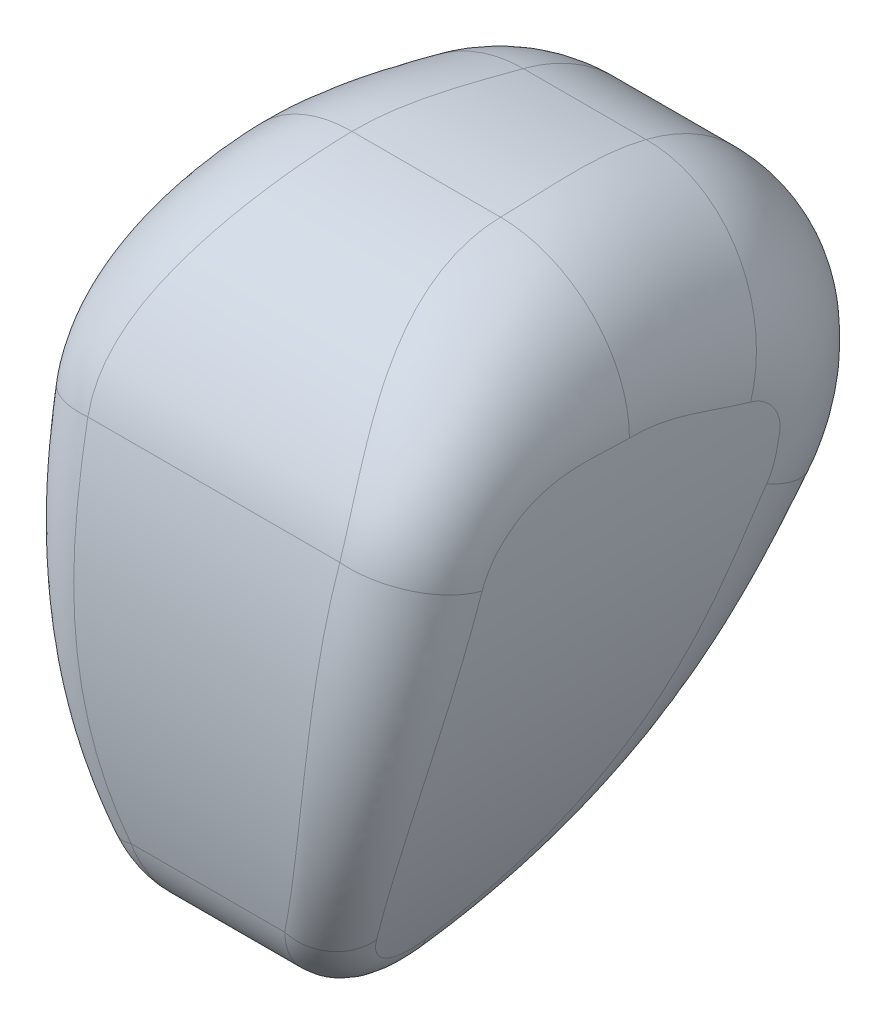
ISO-10303-21;
HEADER;
FILE_DESCRIPTION(('STEP AP214'),'2;1');
FILE_NAME('part.step','',(''),(''),'','','');
FILE_SCHEMA(('AUTOMOTIVE_DESIGN { 1 0 10303 214 1 1 1 1 }'));
ENDSEC;
DATA;
#1=APPLICATION_CONTEXT('core data for automotive mechanical design processes');
#2=APPLICATION_PROTOCOL_DEFINITION('international standard','automotive_design',2000,#1);
#3=PRODUCT_CONTEXT('',#1,'mechanical');
#4=PRODUCT('Part','Part','',(#3));
#5=PRODUCT_RELATED_PRODUCT_CATEGORY('part','',(#4));
#6=PRODUCT_DEFINITION_FORMATION('','',#4);
#7=PRODUCT_DEFINITION_CONTEXT('part definition',#1,'design');
#8=PRODUCT_DEFINITION('design','',#6,#7);
#9=PRODUCT_DEFINITION_SHAPE('','',#8);
#10=(LENGTH_UNIT() NAMED_UNIT(*) SI_UNIT(.MILLI.,.METRE.));
#11=(NAMED_UNIT(*) PLANE_ANGLE_UNIT() SI_UNIT($,.RADIAN.));
#12=(NAMED_UNIT(*) SI_UNIT($,.STERADIAN.) SOLID_ANGLE_UNIT());
#13=UNCERTAINTY_MEASURE_WITH_UNIT(LENGTH_MEASURE(1.E-05),#10,'distance_accuracy_value','');
#14=(GEOMETRIC_REPRESENTATION_CONTEXT(3) GLOBAL_UNCERTAINTY_ASSIGNED_CONTEXT((#13)) GLOBAL_UNIT_ASSIGNED_CONTEXT((#10,
#11,#12)) REPRESENTATION_CONTEXT('',''));
#15=CARTESIAN_POINT('',(0.,0.,0.));
#16=DIRECTION('',(0.,0.,1.));
#17=DIRECTION('',(1.,0.,0.));
#18=AXIS2_PLACEMENT_3D('',#15,#16,#17);
#19=CARTESIAN_POINT('',(104.14,316.316642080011,-8.79621229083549));
#20=DIRECTION('',(-1.,0.,0.));
#21=DIRECTION('',(0.,0.,1.));
#22=AXIS2_PLACEMENT_3D('',#19,#20,#21);
#23=CYLINDRICAL_SURFACE('',#22,254.);
#24=DIRECTION('',(-1.,0.,0.));
#25=VECTOR('',#24,1.);
#26=CARTESIAN_POINT('',(104.14,562.534545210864,-71.1880721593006));
#27=LINE('',#26,#25);
#28=CARTESIAN_POINT('',(25.8098432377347,562.534545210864,-71.1880721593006));
#29=VERTEX_POINT('',#28);
#30=CARTESIAN_POINT('',(-25.8098432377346,562.534545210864,-71.1880721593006));
#31=VERTEX_POINT('',#30);
#32=EDGE_CURVE('E409',#29,#31,#27,.T.);
#33=ORIENTED_EDGE('',*,*,#32,.T.);
#34=CARTESIAN_POINT('',(-31.2381189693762,570.280866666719,-4.53327550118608));
#35=CARTESIAN_POINT('',(-31.2432107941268,570.655668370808,-26.8620663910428));
#36=CARTESIAN_POINT('',(-26.0036752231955,568.063818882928,-49.3678191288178));
#37=CARTESIAN_POINT('',(-25.8098432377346,562.534545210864,-71.1880721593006));
#38=(BOUNDED_CURVE() B_SPLINE_CURVE(3,(#34,#35,#36,#37),.UNSPECIFIED.,.F.,
.F.) B_SPLINE_CURVE_WITH_KNOTS((4,4),(1.01259402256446,1.07840884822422),
.UNSPECIFIED.) CURVE() GEOMETRIC_REPRESENTATION_ITEM() RATIONAL_B_SPLINE_CURVE((1.,1.,1.,1.)) REPRESENTATION_ITEM(''));
#39=CARTESIAN_POINT('',(-31.2381189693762,570.280866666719,-4.53327550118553));
#40=VERTEX_POINT('',#39);
#41=EDGE_CURVE('E486',#31,#40,#38,.F.);
#42=ORIENTED_EDGE('',*,*,#41,.T.);
#43=DIRECTION('',(-1.,0.,0.));
#44=VECTOR('',#43,1.);
#45=CARTESIAN_POINT('',(104.14,570.280866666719,-4.53327550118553));
#46=LINE('',#45,#44);
#47=CARTESIAN_POINT('',(31.2381189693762,570.280866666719,-4.53327550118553));
#48=VERTEX_POINT('',#47);
#49=EDGE_CURVE('E152',#48,#40,#46,.T.);
#50=ORIENTED_EDGE('',*,*,#49,.F.);
#51=CARTESIAN_POINT('',(25.8098432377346,562.534545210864,-71.1880721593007));
#52=CARTESIAN_POINT('',(26.0036752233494,568.06381888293,-49.3678191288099));
#53=CARTESIAN_POINT('',(31.2432107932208,570.655668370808,-26.8620663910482));
#54=CARTESIAN_POINT('',(31.2381189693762,570.280866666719,-4.53327550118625));
#55=(BOUNDED_CURVE() B_SPLINE_CURVE(3,(#51,#52,#53,#54),.UNSPECIFIED.,.F.,
.F.) B_SPLINE_CURVE_WITH_KNOTS((4,4),(1.01259402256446,1.07840884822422),
.UNSPECIFIED.) CURVE() GEOMETRIC_REPRESENTATION_ITEM() RATIONAL_B_SPLINE_CURVE((1.,1.,1.,1.)) REPRESENTATION_ITEM(''));
#56=EDGE_CURVE('E228',#48,#29,#55,.F.);
#57=ORIENTED_EDGE('',*,*,#56,.T.);
#58=EDGE_LOOP('',(#33,#42,#50,#57));
#59=FACE_BOUND('',#58,.T.);
#60=ADVANCED_FACE('F30',(#59),#23,.T.);
#61=CARTESIAN_POINT('',(104.14,476.314103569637,-6.11056211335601));
#62=DIRECTION('',(-1.,0.,0.));
#63=DIRECTION('',(0.,0.,1.));
#64=AXIS2_PLACEMENT_3D('',#61,#62,#63);
#65=CYLINDRICAL_SURFACE('',#64,93.9799999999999);
#66=ORIENTED_EDGE('',*,*,#49,.T.);
#67=CARTESIAN_POINT('',(-52.9827676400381,500.065226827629,84.8186661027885));
#68=CARTESIAN_POINT('',(-53.4453373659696,509.217199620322,82.4281296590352));
#69=CARTESIAN_POINT('',(-52.2782693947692,517.895648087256,78.7115958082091));
#70=CARTESIAN_POINT('',(-48.2949701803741,534.139604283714,68.5890683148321));
#71=CARTESIAN_POINT('',(-45.4824882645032,541.366536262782,62.4252244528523));
#72=CARTESIAN_POINT('',(-39.8191891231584,554.146560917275,47.4719128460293));
#73=CARTESIAN_POINT('',(-36.9622392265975,559.535915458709,38.8849514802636));
#74=CARTESIAN_POINT('',(-32.6725476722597,567.611510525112,18.6936653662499));
#75=CARTESIAN_POINT('',(-31.2366468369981,570.082903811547,7.26035069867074));
#76=CARTESIAN_POINT('',(-31.2381189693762,570.280866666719,-4.53327550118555));
#77=(BOUNDED_CURVE() B_SPLINE_CURVE(3,(#67,#68,#69,#70,#71,#72,#73,#74,#75,#76),.UNSPECIFIED.,
.F.,.F.) B_SPLINE_CURVE_WITH_KNOTS((4,2,2,2,4),(0.445240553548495,0.476297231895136,
0.507353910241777,0.538410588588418,0.569467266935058),
.UNSPECIFIED.) CURVE() GEOMETRIC_REPRESENTATION_ITEM() RATIONAL_B_SPLINE_CURVE((1.,1.,1.,1.,1.,
1.,1.,1.,1.,1.)) REPRESENTATION_ITEM(''));
#78=CARTESIAN_POINT('',(-52.9827676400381,500.065226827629,84.8186661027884));
#79=VERTEX_POINT('',#78);
#80=EDGE_CURVE('E594',#40,#79,#77,.F.);
#81=ORIENTED_EDGE('',*,*,#80,.T.);
#82=DIRECTION('',(-1.,0.,0.));
#83=VECTOR('',#82,1.);
#84=CARTESIAN_POINT('',(104.14,500.065226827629,84.8186661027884));
#85=LINE('',#84,#83);
#86=CARTESIAN_POINT('',(52.982767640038,500.065226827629,84.8186661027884));
#87=VERTEX_POINT('',#86);
#88=EDGE_CURVE('E169',#87,#79,#85,.T.);
#89=ORIENTED_EDGE('',*,*,#88,.F.);
#90=CARTESIAN_POINT('',(31.2381189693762,570.280866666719,-4.53327550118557));
#91=CARTESIAN_POINT('',(31.2366468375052,570.082903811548,7.26035069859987));
#92=CARTESIAN_POINT('',(32.6725476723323,567.611510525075,18.6936653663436));
#93=CARTESIAN_POINT('',(36.962239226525,559.535915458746,38.8849514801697));
#94=CARTESIAN_POINT('',(39.8191891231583,554.146560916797,47.4719128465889));
#95=CARTESIAN_POINT('',(45.4824882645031,541.366536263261,62.4252244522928));
#96=CARTESIAN_POINT('',(48.2949701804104,534.139604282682,68.5890683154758));
#97=CARTESIAN_POINT('',(52.2782693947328,517.895648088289,78.7115958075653));
#98=CARTESIAN_POINT('',(53.4453373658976,509.217199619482,82.4281296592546));
#99=CARTESIAN_POINT('',(52.982767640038,500.065226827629,84.8186661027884));
#100=(BOUNDED_CURVE() B_SPLINE_CURVE(3,(#90,#91,#92,#93,#94,#95,#96,#97,#98,#99),.UNSPECIFIED.,
.F.,.F.) B_SPLINE_CURVE_WITH_KNOTS((4,2,2,2,4),(0.445240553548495,0.476297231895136,
0.507353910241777,0.538410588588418,0.569467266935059),
.UNSPECIFIED.) CURVE() GEOMETRIC_REPRESENTATION_ITEM() RATIONAL_B_SPLINE_CURVE((1.,1.,1.,1.,1.,
1.,1.,1.,1.,1.)) REPRESENTATION_ITEM(''));
#101=EDGE_CURVE('E608',#87,#48,#100,.F.);
#102=ORIENTED_EDGE('',*,*,#101,.T.);
#103=EDGE_LOOP('',(#66,#81,#89,#102));
#104=FACE_BOUND('',#103,.T.);
#105=ADVANCED_FACE('F492',(#104),#65,.T.);
#106=CARTESIAN_POINT('',(104.14,423.03455680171,-210.086938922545));
#107=DIRECTION('',(-1.,0.,0.));
#108=DIRECTION('',(0.,0.,1.));
#109=AXIS2_PLACEMENT_3D('',#106,#107,#108);
#110=CYLINDRICAL_SURFACE('',#109,304.8);
#111=ORIENTED_EDGE('',*,*,#88,.T.);
#112=CARTESIAN_POINT('',(-32.3131315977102,356.243038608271,87.304945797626));
#113=CARTESIAN_POINT('',(-36.673630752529,367.689901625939,89.8758073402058));
#114=CARTESIAN_POINT('',(-40.0542444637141,379.555228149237,91.8413244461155));
#115=CARTESIAN_POINT('',(-45.2368441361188,403.764245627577,94.3466061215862));
#116=CARTESIAN_POINT('',(-47.0583488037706,416.190543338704,94.8841323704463));
#117=CARTESIAN_POINT('',(-50.9217419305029,453.068164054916,94.2248121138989));
#118=CARTESIAN_POINT('',(-51.4142524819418,476.767046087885,90.9042556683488));
#119=CARTESIAN_POINT('',(-52.982767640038,500.065226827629,84.8186661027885));
#120=(BOUNDED_CURVE() B_SPLINE_CURVE(3,(#112,#113,#114,#115,#116,#117,#118,#119),.UNSPECIFIED.,
.F.,.F.) B_SPLINE_CURVE_WITH_KNOTS((4,2,2,4),(0.0898428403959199,0.128533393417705,
0.16722394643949,0.244605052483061),
.UNSPECIFIED.) CURVE() GEOMETRIC_REPRESENTATION_ITEM() RATIONAL_B_SPLINE_CURVE((1.,1.,1.,1.,1.,
1.,1.,1.)) REPRESENTATION_ITEM(''));
#121=CARTESIAN_POINT('',(-32.3131315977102,356.243038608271,87.3049457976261));
#122=VERTEX_POINT('',#121);
#123=EDGE_CURVE('E602',#79,#122,#120,.F.);
#124=ORIENTED_EDGE('',*,*,#123,.T.);
#125=DIRECTION('',(-1.,0.,0.));
#126=VECTOR('',#125,1.);
#127=CARTESIAN_POINT('',(104.14,356.243038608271,87.3049457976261));
#128=LINE('',#127,#126);
#129=CARTESIAN_POINT('',(32.3131315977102,356.243038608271,87.3049457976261));
#130=VERTEX_POINT('',#129);
#131=EDGE_CURVE('E611',#130,#122,#128,.T.);
#132=ORIENTED_EDGE('',*,*,#131,.F.);
#133=CARTESIAN_POINT('',(52.982767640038,500.065226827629,84.8186661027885));
#134=CARTESIAN_POINT('',(51.4142524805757,476.767046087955,90.9042556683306));
#135=CARTESIAN_POINT('',(50.9217419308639,453.068164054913,94.2248121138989));
#136=CARTESIAN_POINT('',(47.0583488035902,416.190543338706,94.8841323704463));
#137=CARTESIAN_POINT('',(45.2368441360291,403.764245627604,94.3466061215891));
#138=CARTESIAN_POINT('',(40.0542444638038,379.555228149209,91.8413244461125));
#139=CARTESIAN_POINT('',(36.673630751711,367.689901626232,89.8758073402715));
#140=CARTESIAN_POINT('',(32.3131315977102,356.243038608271,87.304945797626));
#141=(BOUNDED_CURVE() B_SPLINE_CURVE(3,(#133,#134,#135,#136,#137,#138,#139,#140),.UNSPECIFIED.,
.F.,.F.) B_SPLINE_CURVE_WITH_KNOTS((4,2,2,4),(0.08984284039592,0.167223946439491,
0.205914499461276,0.244605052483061),
.UNSPECIFIED.) CURVE() GEOMETRIC_REPRESENTATION_ITEM() RATIONAL_B_SPLINE_CURVE((1.,1.,1.,1.,1.,
1.,1.,1.)) REPRESENTATION_ITEM(''));
#142=EDGE_CURVE('E132',#130,#87,#141,.F.);
#143=ORIENTED_EDGE('',*,*,#142,.T.);
#144=EDGE_LOOP('',(#111,#124,#132,#143));
#145=FACE_BOUND('',#144,.T.);
#146=ADVANCED_FACE('F501',(#145),#110,.T.);
#147=CARTESIAN_POINT('',(104.14,365.705170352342,45.1744287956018));
#148=DIRECTION('',(-1.,0.,0.));
#149=DIRECTION('',(0.,0.,1.));
#150=AXIS2_PLACEMENT_3D('',#147,#148,#149);
#151=CYLINDRICAL_SURFACE('',#150,43.18);
#152=ORIENTED_EDGE('',*,*,#131,.T.);
#153=CARTESIAN_POINT('',(-24.897575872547,323.936134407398,34.226367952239));
#154=CARTESIAN_POINT('',(-24.5202015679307,322.384736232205,40.1452614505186));
#155=CARTESIAN_POINT('',(-24.4514781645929,322.106348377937,46.2659466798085));
#156=CARTESIAN_POINT('',(-24.9453543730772,324.130796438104,58.3509276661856));
#157=CARTESIAN_POINT('',(-25.4905803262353,326.366059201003,63.9273914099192));
#158=CARTESIAN_POINT('',(-27.8017046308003,336.061454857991,78.7105291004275));
#159=CARTESIAN_POINT('',(-30.1227905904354,346.106137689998,85.0282898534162));
#160=CARTESIAN_POINT('',(-32.3131315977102,356.243038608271,87.3049457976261));
#161=(BOUNDED_CURVE() B_SPLINE_CURVE(3,(#153,#154,#155,#156,#157,#158,#159,#160),.UNSPECIFIED.,
.F.,.F.) B_SPLINE_CURVE_WITH_KNOTS((4,2,2,4),(0.0223167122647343,0.0365128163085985,
0.0507089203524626,0.0791011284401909),
.UNSPECIFIED.) CURVE() GEOMETRIC_REPRESENTATION_ITEM() RATIONAL_B_SPLINE_CURVE((1.,1.,1.,1.,1.,
1.,1.,1.)) REPRESENTATION_ITEM(''));
#162=CARTESIAN_POINT('',(-24.897575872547,323.936134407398,34.2263679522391));
#163=VERTEX_POINT('',#162);
#164=EDGE_CURVE('E11',#122,#163,#161,.F.);
#165=ORIENTED_EDGE('',*,*,#164,.T.);
#166=DIRECTION('',(-1.,0.,0.));
#167=VECTOR('',#166,1.);
#168=CARTESIAN_POINT('',(104.14,323.936134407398,34.2263679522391));
#169=LINE('',#168,#167);
#170=CARTESIAN_POINT('',(24.897575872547,323.936134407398,34.2263679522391));
#171=VERTEX_POINT('',#170);
#172=EDGE_CURVE('E435',#171,#163,#169,.T.);
#173=ORIENTED_EDGE('',*,*,#172,.F.);
#174=CARTESIAN_POINT('',(32.3131315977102,356.243038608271,87.3049457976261));
#175=CARTESIAN_POINT('',(30.1227905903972,346.106137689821,85.0282898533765));
#176=CARTESIAN_POINT('',(27.8017046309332,336.061454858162,78.7105291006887));
#177=CARTESIAN_POINT('',(25.4905803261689,326.366059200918,63.9273914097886));
#178=CARTESIAN_POINT('',(24.9453543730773,324.130796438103,58.3509276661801));
#179=CARTESIAN_POINT('',(24.4514781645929,322.106348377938,46.265946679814));
#180=CARTESIAN_POINT('',(24.5202015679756,322.384736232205,40.1452614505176));
#181=CARTESIAN_POINT('',(24.897575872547,323.936134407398,34.226367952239));
#182=(BOUNDED_CURVE() B_SPLINE_CURVE(3,(#174,#175,#176,#177,#178,#179,#180,#181),.UNSPECIFIED.,
.F.,.F.) B_SPLINE_CURVE_WITH_KNOTS((4,2,2,4),(0.0223167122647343,0.0507089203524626,
0.0649050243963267,0.0791011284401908),
.UNSPECIFIED.) CURVE() GEOMETRIC_REPRESENTATION_ITEM() RATIONAL_B_SPLINE_CURVE((1.,1.,1.,1.,1.,
1.,1.,1.)) REPRESENTATION_ITEM(''));
#183=EDGE_CURVE('E603',#171,#130,#182,.F.);
#184=ORIENTED_EDGE('',*,*,#183,.T.);
#185=EDGE_LOOP('',(#152,#165,#173,#184));
#186=FACE_BOUND('',#185,.T.);
#187=ADVANCED_FACE('F506',(#186),#151,.T.);
#188=CARTESIAN_POINT('',(104.14,569.636345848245,98.6267258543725));
#189=DIRECTION('',(-1.,0.,0.));
#190=DIRECTION('',(0.,0.,1.));
#191=AXIS2_PLACEMENT_3D('',#188,#189,#190);
#192=CYLINDRICAL_SURFACE('',#191,254.);
#193=ORIENTED_EDGE('',*,*,#172,.T.);
#194=CARTESIAN_POINT('',(-18.0470053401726,443.325272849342,-121.740043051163));
#195=CARTESIAN_POINT('',(-16.8332295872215,430.571263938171,-114.429627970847));
#196=CARTESIAN_POINT('',(-17.704890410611,417.056498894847,-105.137279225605));
#197=CARTESIAN_POINT('',(-20.6090830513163,391.457867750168,-83.1775903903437));
#198=CARTESIAN_POINT('',(-22.6163794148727,379.32372503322,-70.5002721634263));
#199=CARTESIAN_POINT('',(-24.9194641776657,363.262424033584,-49.7057155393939));
#200=CARTESIAN_POINT('',(-25.5760621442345,358.248662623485,-42.4622913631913));
#201=CARTESIAN_POINT('',(-26.5749892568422,349.137584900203,-27.7503283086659));
#202=CARTESIAN_POINT('',(-26.9123832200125,345.015089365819,-20.2547136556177));
#203=CARTESIAN_POINT('',(-27.2830816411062,333.900977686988,2.54937007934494));
#204=CARTESIAN_POINT('',(-26.673323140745,328.136991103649,18.1992617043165));
#205=CARTESIAN_POINT('',(-24.897575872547,323.936134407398,34.226367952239));
#206=(BOUNDED_CURVE() B_SPLINE_CURVE(3,(#194,#195,#196,#197,#198,#199,#200,#201,#202,#203,#204,
#205),.UNSPECIFIED.,.F.,.F.) B_SPLINE_CURVE_WITH_KNOTS((4,2,2,2,2,4),(0.476369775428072,
0.524513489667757,0.572657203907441,0.596729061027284,0.620800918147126,0.668944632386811),
.UNSPECIFIED.) CURVE() GEOMETRIC_REPRESENTATION_ITEM() RATIONAL_B_SPLINE_CURVE((1.,1.,1.,1.,1.,
1.,1.,1.,1.,1.,1.,1.)) REPRESENTATION_ITEM(''));
#207=CARTESIAN_POINT('',(-18.0470053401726,443.325272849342,-121.740043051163));
#208=VERTEX_POINT('',#207);
#209=EDGE_CURVE('E41',#163,#208,#206,.F.);
#210=ORIENTED_EDGE('',*,*,#209,.T.);
#211=DIRECTION('',(-1.,0.,0.));
#212=VECTOR('',#211,1.);
#213=CARTESIAN_POINT('',(104.14,443.325272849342,-121.740043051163));
#214=LINE('',#213,#212);
#215=CARTESIAN_POINT('',(18.0470053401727,443.325272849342,-121.740043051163));
#216=VERTEX_POINT('',#215);
#217=EDGE_CURVE('E418',#216,#208,#214,.T.);
#218=ORIENTED_EDGE('',*,*,#217,.F.);
#219=CARTESIAN_POINT('',(24.897575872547,323.936134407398,34.226367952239));
#220=CARTESIAN_POINT('',(26.6763316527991,328.144108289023,18.1721082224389));
#221=CARTESIAN_POINT('',(27.2731453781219,333.877016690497,2.61448179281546));
#222=CARTESIAN_POINT('',(26.8926717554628,344.958205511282,-20.1458986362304));
#223=CARTESIAN_POINT('',(26.5527185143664,349.070072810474,-27.6318211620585));
#224=CARTESIAN_POINT('',(25.5506485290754,358.162864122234,-42.33308410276));
#225=CARTESIAN_POINT('',(24.8943880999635,363.171698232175,-49.5802235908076));
#226=CARTESIAN_POINT('',(22.5992460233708,379.246731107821,-70.4164547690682));
#227=CARTESIAN_POINT('',(20.5947696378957,391.385048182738,-83.1059569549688));
#228=CARTESIAN_POINT('',(17.6928794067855,416.970760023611,-105.072837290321));
#229=CARTESIAN_POINT('',(16.8185509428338,430.417024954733,-114.341220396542));
#230=CARTESIAN_POINT('',(18.0470053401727,443.325272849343,-121.740043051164));
#231=(BOUNDED_CURVE() B_SPLINE_CURVE(3,(#219,#220,#221,#222,#223,#224,#225,#226,#227,#228,#229,
#230),.UNSPECIFIED.,.F.,.F.) B_SPLINE_CURVE_WITH_KNOTS((4,2,2,2,2,4),(-0.00170403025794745,
0.0464530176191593,0.0705315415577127,0.0946100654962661,0.142767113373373,0.19092416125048),
.UNSPECIFIED.) CURVE() GEOMETRIC_REPRESENTATION_ITEM() RATIONAL_B_SPLINE_CURVE((1.,1.,1.,1.,1.,
1.,1.,1.,1.,1.,1.,1.)) REPRESENTATION_ITEM(''));
#232=EDGE_CURVE('E296',#216,#171,#231,.F.);
#233=ORIENTED_EDGE('',*,*,#232,.T.);
#234=EDGE_LOOP('',(#193,#210,#218,#233));
#235=FACE_BOUND('',#234,.T.);
#236=ADVANCED_FACE('F452',(#235),#192,.T.);
#237=CARTESIAN_POINT('',(104.14,483.744816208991,-51.2226770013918));
#238=DIRECTION('',(-1.,0.,0.));
#239=DIRECTION('',(0.,0.,1.));
#240=AXIS2_PLACEMENT_3D('',#237,#238,#239);
#241=CYLINDRICAL_SURFACE('',#240,81.28);
#242=ORIENTED_EDGE('',*,*,#217,.T.);
#243=CARTESIAN_POINT('',(-25.8098432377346,562.534545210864,-71.1880721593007));
#244=CARTESIAN_POINT('',(-25.7801578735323,560.216172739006,-80.337099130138));
#245=CARTESIAN_POINT('',(-25.6450409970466,556.289155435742,-88.8255372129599));
#246=CARTESIAN_POINT('',(-25.2164856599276,547.091433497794,-102.835294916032));
#247=CARTESIAN_POINT('',(-24.9214015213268,541.749616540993,-108.546800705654));
#248=CARTESIAN_POINT('',(-24.2444307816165,531.666475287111,-117.208483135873));
#249=CARTESIAN_POINT('',(-23.8625607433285,526.877585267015,-120.272283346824));
#250=CARTESIAN_POINT('',(-23.0799068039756,518.678200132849,-124.761391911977));
#251=CARTESIAN_POINT('',(-22.6800416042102,515.288818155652,-126.202576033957));
#252=CARTESIAN_POINT('',(-21.8952674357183,509.199048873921,-128.482571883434));
#253=CARTESIAN_POINT('',(-21.5127477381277,506.614819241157,-129.282497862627));
#254=CARTESIAN_POINT('',(-20.7691473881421,500.501239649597,-130.819127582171));
#255=CARTESIAN_POINT('',(-20.4099606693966,497.047664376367,-131.559627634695));
#256=CARTESIAN_POINT('',(-19.7047695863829,487.190203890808,-132.580655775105));
#257=CARTESIAN_POINT('',(-19.3553973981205,480.622291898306,-132.877815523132));
#258=CARTESIAN_POINT('',(-18.6732571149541,463.953134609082,-130.504460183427));
#259=CARTESIAN_POINT('',(-18.33349455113,453.646461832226,-127.656000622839));
#260=CARTESIAN_POINT('',(-18.0470053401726,443.325272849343,-121.740043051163));
#261=(BOUNDED_CURVE() B_SPLINE_CURVE(3,(#243,#244,#245,#246,#247,#248,#249,#250,#251,#252,#253,
#254,#255,#256,#257,#258,#259,#260),.UNSPECIFIED.,.F.,.F.) B_SPLINE_CURVE_WITH_KNOTS((4,2,2,2,2,
2,2,2,4),(0.177837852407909,0.201439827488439,0.225041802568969,0.248643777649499,
0.272245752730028,0.295847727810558,0.319449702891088,0.343051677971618,0.366653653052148),
.UNSPECIFIED.) CURVE() GEOMETRIC_REPRESENTATION_ITEM() RATIONAL_B_SPLINE_CURVE((1.,1.,1.,1.,1.,
1.,1.,1.,1.,1.,1.,1.,1.,1.,1.,1.,1.,1.)) REPRESENTATION_ITEM(''));
#262=EDGE_CURVE('E475',#208,#31,#261,.F.);
#263=ORIENTED_EDGE('',*,*,#262,.T.);
#264=ORIENTED_EDGE('',*,*,#32,.F.);
#265=CARTESIAN_POINT('',(18.0470053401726,443.325272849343,-121.740043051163));
#266=CARTESIAN_POINT('',(18.3334945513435,453.646461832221,-127.656000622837));
#267=CARTESIAN_POINT('',(18.6732571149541,463.953134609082,-130.504460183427));
#268=CARTESIAN_POINT('',(19.3553973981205,480.622291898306,-132.877815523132));
#269=CARTESIAN_POINT('',(19.7047695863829,487.190203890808,-132.580655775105));
#270=CARTESIAN_POINT('',(20.4099606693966,497.047664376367,-131.559627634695));
#271=CARTESIAN_POINT('',(20.7691473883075,500.501239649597,-130.819127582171));
#272=CARTESIAN_POINT('',(21.5127477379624,506.614819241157,-129.282497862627));
#273=CARTESIAN_POINT('',(21.8952674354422,509.199048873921,-128.482571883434));
#274=CARTESIAN_POINT('',(22.6800416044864,515.288818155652,-126.202576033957));
#275=CARTESIAN_POINT('',(23.0799068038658,518.678200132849,-124.761391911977));
#276=CARTESIAN_POINT('',(23.8625607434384,526.877585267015,-120.272283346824));
#277=CARTESIAN_POINT('',(24.2444307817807,531.666475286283,-117.208483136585));
#278=CARTESIAN_POINT('',(24.9214015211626,541.749616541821,-108.546800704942));
#279=CARTESIAN_POINT('',(25.2164856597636,547.091433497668,-102.835294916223));
#280=CARTESIAN_POINT('',(25.6450409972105,556.289155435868,-88.825537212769));
#281=CARTESIAN_POINT('',(25.7801578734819,560.216172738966,-80.3370991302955));
#282=CARTESIAN_POINT('',(25.8098432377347,562.534545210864,-71.1880721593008));
#283=(BOUNDED_CURVE() B_SPLINE_CURVE(3,(#265,#266,#267,#268,#269,#270,#271,#272,#273,#274,#275,
#276,#277,#278,#279,#280,#281,#282),.UNSPECIFIED.,.F.,.F.) B_SPLINE_CURVE_WITH_KNOTS((4,2,2,2,2,
2,2,2,4),(0.177837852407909,0.201439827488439,0.225041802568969,0.248643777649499,
0.272245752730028,0.295847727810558,0.319449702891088,0.343051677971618,0.366653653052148),
.UNSPECIFIED.) CURVE() GEOMETRIC_REPRESENTATION_ITEM() RATIONAL_B_SPLINE_CURVE((1.,1.,1.,1.,1.,
1.,1.,1.,1.,1.,1.,1.,1.,1.,1.,1.,1.,1.)) REPRESENTATION_ITEM(''));
#284=EDGE_CURVE('E385',#29,#216,#283,.F.);
#285=ORIENTED_EDGE('',*,*,#284,.T.);
#286=EDGE_LOOP('',(#242,#263,#264,#285));
#287=FACE_BOUND('',#286,.T.);
#288=ADVANCED_FACE('F182',(#287),#241,.T.);
#289=CARTESIAN_POINT('',(-367.316847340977,523.802207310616,494.355899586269));
#290=DIRECTION('',(0.,0.,-1.));
#291=DIRECTION('',(-1.,0.,0.));
#292=AXIS2_PLACEMENT_3D('',#289,#290,#291);
#293=CYLINDRICAL_SURFACE('',#292,451.953893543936);
#294=CARTESIAN_POINT('',(83.37784657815,490.088489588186,55.328105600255));
#295=CARTESIAN_POINT('',(83.8756099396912,496.742733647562,53.7072067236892));
#296=CARTESIAN_POINT('',(84.1520057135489,502.433826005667,49.7967633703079));
#297=CARTESIAN_POINT('',(84.4763301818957,511.009328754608,39.7041987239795));
#298=CARTESIAN_POINT('',(84.5251424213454,513.641812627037,33.7184959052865));
#299=CARTESIAN_POINT('',(84.5809568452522,516.536403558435,21.7204977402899));
#300=CARTESIAN_POINT('',(84.5813844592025,516.707870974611,15.8529493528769));
#301=CARTESIAN_POINT('',(84.5768999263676,516.42774510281,4.76246001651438));
#302=CARTESIAN_POINT('',(84.5685799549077,515.935077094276,-0.375541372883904));
#303=CARTESIAN_POINT('',(84.5702336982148,516.031243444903,-5.42849222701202));
#304=(BOUNDED_CURVE() B_SPLINE_CURVE(3,(#294,#295,#296,#297,#298,#299,#300,#301,#302,#303),
.UNSPECIFIED.,.F.,.F.) B_SPLINE_CURVE_WITH_KNOTS((4,2,2,2,4),(0.445240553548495,
0.476297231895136,0.507353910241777,0.538410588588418,0.569467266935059),
.UNSPECIFIED.) CURVE() GEOMETRIC_REPRESENTATION_ITEM() RATIONAL_B_SPLINE_CURVE((1.,1.,1.,1.,1.,
1.,1.,1.,1.,1.)) REPRESENTATION_ITEM(''));
#305=CARTESIAN_POINT('',(84.5702336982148,516.031243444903,-5.42849222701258));
#306=VERTEX_POINT('',#305);
#307=CARTESIAN_POINT('',(83.37784657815,490.088489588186,55.328105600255));
#308=VERTEX_POINT('',#307);
#309=EDGE_CURVE('E158',#306,#308,#304,.F.);
#310=ORIENTED_EDGE('',*,*,#309,.T.);
#311=CARTESIAN_POINT('',(51.126485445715,353.017257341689,67.4788201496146));
#312=CARTESIAN_POINT('',(55.6926805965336,364.204975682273,69.878510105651));
#313=CARTESIAN_POINT('',(59.8523424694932,375.690546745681,71.087670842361));
#314=CARTESIAN_POINT('',(67.2075005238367,398.905562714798,71.5180047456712));
#315=CARTESIAN_POINT('',(70.4218762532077,410.713072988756,70.7396735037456));
#316=CARTESIAN_POINT('',(78.4491261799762,445.551961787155,66.3259053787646));
#317=CARTESIAN_POINT('',(81.6981939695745,467.634409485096,60.7976665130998));
#318=CARTESIAN_POINT('',(83.37784657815,490.088489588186,55.3281056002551));
#319=(BOUNDED_CURVE() B_SPLINE_CURVE(3,(#311,#312,#313,#314,#315,#316,#317,#318),.UNSPECIFIED.,
.F.,.F.) B_SPLINE_CURVE_WITH_KNOTS((4,2,2,4),(0.08984284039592,0.128533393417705,
0.167223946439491,0.244605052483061),
.UNSPECIFIED.) CURVE() GEOMETRIC_REPRESENTATION_ITEM() RATIONAL_B_SPLINE_CURVE((1.,1.,1.,1.,1.,
1.,1.,1.)) REPRESENTATION_ITEM(''));
#320=CARTESIAN_POINT('',(51.1264854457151,353.017257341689,67.4788201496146));
#321=VERTEX_POINT('',#320);
#322=EDGE_CURVE('E129',#308,#321,#319,.F.);
#323=ORIENTED_EDGE('',*,*,#322,.T.);
#324=CARTESIAN_POINT('',(43.3618280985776,335.108414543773,39.3783965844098));
#325=CARTESIAN_POINT('',(42.966708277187,334.248464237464,42.5117689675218));
#326=CARTESIAN_POINT('',(42.8947294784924,334.094100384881,45.7522912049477));
#327=CARTESIAN_POINT('',(43.4118558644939,335.216322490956,52.1502223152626));
#328=CARTESIAN_POINT('',(43.9827493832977,336.455406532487,55.1024678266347));
#329=CARTESIAN_POINT('',(46.4026743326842,341.829902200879,62.9288348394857));
#330=CARTESIAN_POINT('',(48.8333016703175,347.39868578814,66.2736745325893));
#331=CARTESIAN_POINT('',(51.1264854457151,353.017257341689,67.4788201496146));
#332=(BOUNDED_CURVE() B_SPLINE_CURVE(3,(#324,#325,#326,#327,#328,#329,#330,#331),.UNSPECIFIED.,
.F.,.F.) B_SPLINE_CURVE_WITH_KNOTS((4,2,2,4),(0.0223167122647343,0.0365128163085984,
0.0507089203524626,0.0791011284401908),
.UNSPECIFIED.) CURVE() GEOMETRIC_REPRESENTATION_ITEM() RATIONAL_B_SPLINE_CURVE((1.,1.,1.,1.,1.,
1.,1.,1.)) REPRESENTATION_ITEM(''));
#333=CARTESIAN_POINT('',(43.3618280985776,335.108414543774,39.3783965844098));
#334=VERTEX_POINT('',#333);
#335=EDGE_CURVE('E142',#321,#334,#332,.F.);
#336=ORIENTED_EDGE('',*,*,#335,.T.);
#337=CARTESIAN_POINT('',(81.0418807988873,466.909564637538,-66.6483508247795));
#338=CARTESIAN_POINT('',(79.6149066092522,455.663886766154,-61.1081398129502));
#339=CARTESIAN_POINT('',(77.509587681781,442.686377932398,-56.4873029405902));
#340=CARTESIAN_POINT('',(71.7740541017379,415.869286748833,-45.5714738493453));
#341=CARTESIAN_POINT('',(68.1313560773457,402.035964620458,-39.2273423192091));
#342=CARTESIAN_POINT('',(62.1420657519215,382.832982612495,-26.7745707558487));
#343=CARTESIAN_POINT('',(60.0667826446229,376.690935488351,-22.1433306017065));
#344=CARTESIAN_POINT('',(56.0008320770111,365.370405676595,-12.0706812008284));
#345=CARTESIAN_POINT('',(54.003471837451,360.166778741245,-6.60317874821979));
#346=CARTESIAN_POINT('',(48.4135971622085,346.233372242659,11.0737623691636));
#347=CARTESIAN_POINT('',(45.228404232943,339.170885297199,24.5761067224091));
#348=CARTESIAN_POINT('',(43.3618280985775,335.108414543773,39.3783965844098));
#349=(BOUNDED_CURVE() B_SPLINE_CURVE(3,(#337,#338,#339,#340,#341,#342,#343,#344,#345,#346,#347,
#348),.UNSPECIFIED.,.F.,.F.) B_SPLINE_CURVE_WITH_KNOTS((4,2,2,2,2,4),(-0.00170403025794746,
0.0464530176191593,0.0946100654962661,0.11868858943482,0.142767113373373,0.19092416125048),
.UNSPECIFIED.) CURVE() GEOMETRIC_REPRESENTATION_ITEM() RATIONAL_B_SPLINE_CURVE((1.,1.,1.,1.,1.,
1.,1.,1.,1.,1.,1.,1.)) REPRESENTATION_ITEM(''));
#350=CARTESIAN_POINT('',(81.0418807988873,466.909564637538,-66.6483508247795));
#351=VERTEX_POINT('',#350);
#352=EDGE_CURVE('E151',#334,#351,#349,.F.);
#353=ORIENTED_EDGE('',*,*,#352,.T.);
#354=CARTESIAN_POINT('',(84.1693940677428,503.247506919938,-56.8379443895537));
#355=CARTESIAN_POINT('',(84.1352865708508,502.498332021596,-59.4122667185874));
#356=CARTESIAN_POINT('',(84.0712016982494,501.135847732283,-61.7737311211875));
#357=CARTESIAN_POINT('',(83.8975240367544,497.907695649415,-65.5238837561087));
#358=CARTESIAN_POINT('',(83.7860395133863,496.023452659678,-66.9659106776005));
#359=CARTESIAN_POINT('',(83.5538832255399,492.480360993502,-68.9561625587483));
#360=CARTESIAN_POINT('',(83.4332243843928,490.806096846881,-69.5384828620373));
#361=CARTESIAN_POINT('',(83.2151956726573,487.951842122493,-70.1900967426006));
#362=CARTESIAN_POINT('',(83.1189008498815,486.774556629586,-70.264995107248));
#363=CARTESIAN_POINT('',(82.9431670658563,484.695563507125,-70.2403073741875));
#364=CARTESIAN_POINT('',(82.8665052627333,483.82470869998,-70.1306035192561));
#365=CARTESIAN_POINT('',(82.6918524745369,481.904457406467,-69.919774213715));
#366=CARTESIAN_POINT('',(82.5960548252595,480.876935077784,-69.8177832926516));
#367=CARTESIAN_POINT('',(82.3275708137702,478.150309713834,-69.5773885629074));
#368=CARTESIAN_POINT('',(82.1509478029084,476.41378481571,-69.4415465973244));
#369=CARTESIAN_POINT('',(81.67884361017,472.131800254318,-68.6409626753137));
#370=CARTESIAN_POINT('',(81.374766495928,469.532965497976,-67.9407757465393));
#371=CARTESIAN_POINT('',(81.0418807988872,466.909564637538,-66.6483508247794));
#372=(BOUNDED_CURVE() B_SPLINE_CURVE(3,(#354,#355,#356,#357,#358,#359,#360,#361,#362,#363,#364,
#365,#366,#367,#368,#369,#370,#371),.UNSPECIFIED.,.F.,.F.) B_SPLINE_CURVE_WITH_KNOTS((4,2,2,2,2,
2,2,2,4),(0.177837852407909,0.201439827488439,0.225041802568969,0.248643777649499,
0.272245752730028,0.295847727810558,0.319449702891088,0.343051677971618,0.366653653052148),
.UNSPECIFIED.) CURVE() GEOMETRIC_REPRESENTATION_ITEM() RATIONAL_B_SPLINE_CURVE((1.,1.,1.,1.,1.,
1.,1.,1.,1.,1.,1.,1.,1.,1.,1.,1.,1.,1.)) REPRESENTATION_ITEM(''));
#373=CARTESIAN_POINT('',(84.1693940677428,503.247506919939,-56.8379443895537));
#374=VERTEX_POINT('',#373);
#375=EDGE_CURVE('E218',#351,#374,#372,.F.);
#376=ORIENTED_EDGE('',*,*,#375,.T.);
#377=CARTESIAN_POINT('',(84.5702336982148,516.031243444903,-5.42849222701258));
#378=CARTESIAN_POINT('',(84.5760799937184,516.371209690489,-23.2916300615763));
#379=CARTESIAN_POINT('',(84.3899973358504,508.093081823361,-40.1875310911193));
#380=CARTESIAN_POINT('',(84.1693940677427,503.247506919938,-56.8379443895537));
#381=(BOUNDED_CURVE() B_SPLINE_CURVE(3,(#377,#378,#379,#380),.UNSPECIFIED.,.F.,
.F.) B_SPLINE_CURVE_WITH_KNOTS((4,4),(1.01259402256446,1.07840884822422),
.UNSPECIFIED.) CURVE() GEOMETRIC_REPRESENTATION_ITEM() RATIONAL_B_SPLINE_CURVE((1.,1.,1.,1.)) REPRESENTATION_ITEM(''));
#382=EDGE_CURVE('E215',#374,#306,#381,.F.);
#383=ORIENTED_EDGE('',*,*,#382,.T.);
#384=EDGE_LOOP('',(#310,#323,#336,#353,#376,#383));
#385=FACE_BOUND('',#384,.T.);
#386=ADVANCED_FACE('F156',(#385),#293,.T.);
#387=CARTESIAN_POINT('',(81.0418807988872,466.909564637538,-66.6483508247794));
#388=CARTESIAN_POINT('',(81.374766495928,469.532965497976,-67.9407757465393));
#389=CARTESIAN_POINT('',(81.67884361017,472.131800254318,-68.6409626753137));
#390=CARTESIAN_POINT('',(82.1509478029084,476.41378481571,-69.4415465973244));
#391=CARTESIAN_POINT('',(82.3275708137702,478.150309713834,-69.5773885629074));
#392=CARTESIAN_POINT('',(82.5960548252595,480.876935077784,-69.8177832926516));
#393=CARTESIAN_POINT('',(82.6918524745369,481.904457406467,-69.919774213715));
#394=CARTESIAN_POINT('',(82.8665052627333,483.82470869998,-70.1306035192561));
#395=CARTESIAN_POINT('',(82.9431670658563,484.695563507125,-70.2403073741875));
#396=CARTESIAN_POINT('',(83.1189008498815,486.774556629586,-70.264995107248));
#397=CARTESIAN_POINT('',(83.2151956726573,487.951842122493,-70.1900967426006));
#398=CARTESIAN_POINT('',(83.4332243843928,490.806096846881,-69.5384828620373));
#399=CARTESIAN_POINT('',(83.5538832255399,492.480360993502,-68.9561625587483));
#400=CARTESIAN_POINT('',(83.7860395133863,496.023452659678,-66.9659106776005));
#401=CARTESIAN_POINT('',(83.8975240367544,497.907695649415,-65.5238837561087));
#402=CARTESIAN_POINT('',(84.0712016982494,501.135847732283,-61.7737311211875));
#403=CARTESIAN_POINT('',(84.1352865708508,502.498332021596,-59.4122667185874));
#404=CARTESIAN_POINT('',(84.1693940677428,503.247506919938,-56.8379443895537));
#405=CARTESIAN_POINT('',(77.3307576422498,437.662998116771,-118.494508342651));
#406=CARTESIAN_POINT('',(78.713838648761,447.191200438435,-125.056531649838));
#407=CARTESIAN_POINT('',(79.9941312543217,457.231181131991,-128.840016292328));
#408=CARTESIAN_POINT('',(81.9219011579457,473.956611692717,-132.636127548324));
#409=CARTESIAN_POINT('',(82.6076323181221,480.793613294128,-132.864780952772));
#410=CARTESIAN_POINT('',(83.5889263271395,491.161073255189,-132.547784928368));
#411=CARTESIAN_POINT('',(83.9037952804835,494.867542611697,-132.012835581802));
#412=CARTESIAN_POINT('',(84.4379685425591,501.464279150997,-130.799375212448));
#413=CARTESIAN_POINT('',(84.6494504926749,504.280073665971,-130.112587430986));
#414=CARTESIAN_POINT('',(85.109638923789,510.927124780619,-128.047221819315));
#415=CARTESIAN_POINT('',(85.3483199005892,514.636484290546,-126.701314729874));
#416=CARTESIAN_POINT('',(85.8448015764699,523.616992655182,-122.330325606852));
#417=CARTESIAN_POINT('',(86.0964143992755,528.86753487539,-119.282174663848));
#418=CARTESIAN_POINT('',(86.502343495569,539.894863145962,-110.470754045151));
#419=CARTESIAN_POINT('',(86.6533005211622,545.717617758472,-104.587812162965));
#420=CARTESIAN_POINT('',(86.8219591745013,555.67604320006,-90.0994627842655));
#421=CARTESIAN_POINT('',(86.846342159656,559.889332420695,-81.3042597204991));
#422=CARTESIAN_POINT('',(86.8609050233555,562.366839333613,-71.8498922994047));
#423=CARTESIAN_POINT('',(18.0470053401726,443.325272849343,-121.740043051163));
#424=CARTESIAN_POINT('',(18.3334945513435,453.646461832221,-127.656000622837));
#425=CARTESIAN_POINT('',(18.6732571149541,463.953134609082,-130.504460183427));
#426=CARTESIAN_POINT('',(19.3553973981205,480.622291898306,-132.877815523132));
#427=CARTESIAN_POINT('',(19.7047695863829,487.190203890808,-132.580655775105));
#428=CARTESIAN_POINT('',(20.4099606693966,497.047664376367,-131.559627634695));
#429=CARTESIAN_POINT('',(20.7691473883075,500.501239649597,-130.819127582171));
#430=CARTESIAN_POINT('',(21.5127477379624,506.614819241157,-129.282497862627));
#431=CARTESIAN_POINT('',(21.8952674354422,509.199048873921,-128.482571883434));
#432=CARTESIAN_POINT('',(22.6800416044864,515.288818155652,-126.202576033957));
#433=CARTESIAN_POINT('',(23.0799068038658,518.678200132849,-124.761391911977));
#434=CARTESIAN_POINT('',(23.8625607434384,526.877585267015,-120.272283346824));
#435=CARTESIAN_POINT('',(24.2444307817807,531.666475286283,-117.208483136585));
#436=CARTESIAN_POINT('',(24.9214015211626,541.749616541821,-108.546800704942));
#437=CARTESIAN_POINT('',(25.2164856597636,547.091433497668,-102.835294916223));
#438=CARTESIAN_POINT('',(25.6450409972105,556.289155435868,-88.825537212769));
#439=CARTESIAN_POINT('',(25.7801578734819,560.216172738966,-80.3370991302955));
#440=CARTESIAN_POINT('',(25.8098432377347,562.534545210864,-71.1880721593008));
#441=(BOUNDED_SURFACE() B_SPLINE_SURFACE(2,3,((#387,#388,#389,#390,#391,#392,#393,#394,#395,
#396,#397,#398,#399,#400,#401,#402,#403,#404),(#405,#406,#407,#408,#409,#410,#411,#412,#413,
#414,#415,#416,#417,#418,#419,#420,#421,#422),(#423,#424,#425,#426,#427,#428,#429,#430,#431,
#432,#433,#434,#435,#436,#437,#438,#439,#440)),.UNSPECIFIED.,.F.,.F.,
.F.) B_SPLINE_SURFACE_WITH_KNOTS((3,3),(4,2,2,2,2,2,2,2,4),(0.,1.),(0.177837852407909,
0.201439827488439,0.225041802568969,0.248643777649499,0.272245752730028,0.295847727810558,
0.319449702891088,0.343051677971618,0.366653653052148),
.UNSPECIFIED.) GEOMETRIC_REPRESENTATION_ITEM() RATIONAL_B_SPLINE_SURFACE(((1.,1.,1.,1.,1.,1.,1.,
1.,1.,1.,1.,1.,1.,1.,1.,1.,1.,1.),(0.728903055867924,0.722407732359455,0.716724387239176,
0.708370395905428,0.70552936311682,0.701527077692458,0.70028949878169,0.698223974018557,
0.69743011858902,0.6957441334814,0.694892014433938,0.693216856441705,0.692422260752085,
0.691337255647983,0.691066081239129,0.691026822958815,0.691230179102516,0.691344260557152),(1.,
1.,1.,1.,1.,1.,1.,1.,1.,1.,1.,1.,1.,1.,1.,1.,1.,1.))) REPRESENTATION_ITEM('') SURFACE());
#442=CARTESIAN_POINT('',(18.0470053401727,443.325272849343,-121.740043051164));
#443=CARTESIAN_POINT('',(77.3307576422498,437.662998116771,-118.494508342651));
#444=CARTESIAN_POINT('',(81.0418807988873,466.909564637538,-66.6483508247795));
#445=(BOUNDED_CURVE() B_SPLINE_CURVE(2,(#442,#443,#444),.UNSPECIFIED.,.F.,
.F.) B_SPLINE_CURVE_WITH_KNOTS((3,3),(0.,1.),
.UNSPECIFIED.) CURVE() GEOMETRIC_REPRESENTATION_ITEM() RATIONAL_B_SPLINE_CURVE((1.,
0.728903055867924,1.)) REPRESENTATION_ITEM(''));
#446=EDGE_CURVE('E233',#216,#351,#445,.T.);
#447=CARTESIAN_POINT('',(84.1693940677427,503.247506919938,-56.8379443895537));
#448=CARTESIAN_POINT('',(86.8609050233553,562.366839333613,-71.8498922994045));
#449=CARTESIAN_POINT('',(25.8098432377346,562.534545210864,-71.1880721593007));
#450=(BOUNDED_CURVE() B_SPLINE_CURVE(2,(#447,#448,#449),.UNSPECIFIED.,.F.,
.F.) B_SPLINE_CURVE_WITH_KNOTS((3,3),(0.,1.),
.UNSPECIFIED.) CURVE() GEOMETRIC_REPRESENTATION_ITEM() RATIONAL_B_SPLINE_CURVE((1.,
0.691344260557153,1.)) REPRESENTATION_ITEM(''));
#451=EDGE_CURVE('E368',#374,#29,#450,.T.);
#452=ORIENTED_EDGE('',*,*,#446,.F.);
#453=ORIENTED_EDGE('',*,*,#284,.F.);
#454=ORIENTED_EDGE('',*,*,#451,.F.);
#455=ORIENTED_EDGE('',*,*,#375,.F.);
#456=EDGE_LOOP('',(#452,#453,#454,#455));
#457=FACE_BOUND('',#456,.T.);
#458=ADVANCED_FACE('F181',(#457),#441,.T.);
#459=CARTESIAN_POINT('',(84.1693940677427,503.247506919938,-56.8379443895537));
#460=CARTESIAN_POINT('',(84.3899973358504,508.093081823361,-40.1875310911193));
#461=CARTESIAN_POINT('',(84.5760799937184,516.371209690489,-23.2916300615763));
#462=CARTESIAN_POINT('',(84.5702336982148,516.031243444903,-5.42849222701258));
#463=CARTESIAN_POINT('',(86.8609050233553,562.366839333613,-71.8498922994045));
#464=CARTESIAN_POINT('',(86.4775650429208,568.065622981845,-49.6074808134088));
#465=CARTESIAN_POINT('',(85.4693761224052,570.657561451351,-26.8929329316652));
#466=CARTESIAN_POINT('',(85.5031433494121,570.280603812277,-4.51761596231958));
#467=CARTESIAN_POINT('',(25.8098432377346,562.534545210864,-71.1880721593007));
#468=CARTESIAN_POINT('',(26.0036752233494,568.06381888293,-49.3678191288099));
#469=CARTESIAN_POINT('',(31.2432107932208,570.655668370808,-26.8620663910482));
#470=CARTESIAN_POINT('',(31.2381189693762,570.280866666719,-4.53327550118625));
#471=(BOUNDED_SURFACE() B_SPLINE_SURFACE(2,3,((#459,#460,#461,#462),(#463,#464,#465,#466),(#467,
#468,#469,#470)),.UNSPECIFIED.,.F.,.F.,.F.) B_SPLINE_SURFACE_WITH_KNOTS((3,3),(4,4),(0.,1.),
(1.01259402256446,1.07840884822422),
.UNSPECIFIED.) GEOMETRIC_REPRESENTATION_ITEM() RATIONAL_B_SPLINE_SURFACE(((1.,1.,1.,1.),
(0.691344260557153,0.694777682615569,0.70128447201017,0.701002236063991),(1.,1.,1.,1.))) REPRESENTATION_ITEM('') SURFACE());
#472=CARTESIAN_POINT('',(84.5702336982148,516.031243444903,-5.42849222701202));
#473=CARTESIAN_POINT('',(85.5031433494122,570.280603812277,-4.5176159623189));
#474=CARTESIAN_POINT('',(31.2381189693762,570.280866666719,-4.53327550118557));
#475=(BOUNDED_CURVE() B_SPLINE_CURVE(2,(#472,#473,#474),.UNSPECIFIED.,.F.,
.F.) B_SPLINE_CURVE_WITH_KNOTS((3,3),(0.,1.),
.UNSPECIFIED.) CURVE() GEOMETRIC_REPRESENTATION_ITEM() RATIONAL_B_SPLINE_CURVE((1.,
0.701002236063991,1.)) REPRESENTATION_ITEM(''));
#476=EDGE_CURVE('E225',#306,#48,#475,.T.);
#477=ORIENTED_EDGE('',*,*,#451,.T.);
#478=ORIENTED_EDGE('',*,*,#56,.F.);
#479=ORIENTED_EDGE('',*,*,#476,.F.);
#480=ORIENTED_EDGE('',*,*,#382,.F.);
#481=EDGE_LOOP('',(#477,#478,#479,#480));
#482=FACE_BOUND('',#481,.T.);
#483=ADVANCED_FACE('F227',(#482),#471,.T.);
#484=CARTESIAN_POINT('',(43.3618280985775,335.108414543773,39.3783965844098));
#485=CARTESIAN_POINT('',(45.228404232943,339.170885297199,24.5761067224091));
#486=CARTESIAN_POINT('',(48.4135971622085,346.233372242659,11.0737623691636));
#487=CARTESIAN_POINT('',(54.003471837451,360.166778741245,-6.60317874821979));
#488=CARTESIAN_POINT('',(56.0008320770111,365.370405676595,-12.0706812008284));
#489=CARTESIAN_POINT('',(60.0667826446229,376.690935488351,-22.1433306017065));
#490=CARTESIAN_POINT('',(62.1420657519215,382.832982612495,-26.7745707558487));
#491=CARTESIAN_POINT('',(68.1313560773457,402.035964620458,-39.2273423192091));
#492=CARTESIAN_POINT('',(71.7740541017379,415.869286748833,-45.5714738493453));
#493=CARTESIAN_POINT('',(77.509587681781,442.686377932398,-56.4873029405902));
#494=CARTESIAN_POINT('',(79.6149066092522,455.663886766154,-61.1081398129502));
#495=CARTESIAN_POINT('',(81.0418807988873,466.909564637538,-66.6483508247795));
#496=CARTESIAN_POINT('',(38.0500253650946,323.547652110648,35.7085054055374));
#497=CARTESIAN_POINT('',(40.036684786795,327.570364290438,19.9657606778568));
#498=CARTESIAN_POINT('',(42.698166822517,332.993412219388,4.93104171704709));
#499=CARTESIAN_POINT('',(47.4105047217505,343.229844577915,-16.8467381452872));
#500=CARTESIAN_POINT('',(49.1031422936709,346.99737323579,-23.9770780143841));
#501=CARTESIAN_POINT('',(52.6819482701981,355.298176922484,-38.0050397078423));
#502=CARTESIAN_POINT('',(54.5779300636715,359.85797982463,-44.9362819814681));
#503=CARTESIAN_POINT('',(60.361890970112,374.570791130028,-65.0530602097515));
#504=CARTESIAN_POINT('',(64.3538544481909,385.790798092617,-77.6094992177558));
#505=CARTESIAN_POINT('',(71.6208895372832,410.537713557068,-100.243133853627));
#506=CARTESIAN_POINT('',(74.8611875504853,424.093376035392,-110.275278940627));
#507=CARTESIAN_POINT('',(77.3307576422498,437.662998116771,-118.494508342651));
#508=CARTESIAN_POINT('',(24.897575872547,323.936134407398,34.226367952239));
#509=CARTESIAN_POINT('',(26.6763316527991,328.144108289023,18.1721082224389));
#510=CARTESIAN_POINT('',(27.2731453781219,333.877016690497,2.61448179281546));
#511=CARTESIAN_POINT('',(26.8926717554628,344.958205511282,-20.1458986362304));
#512=CARTESIAN_POINT('',(26.5527185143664,349.070072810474,-27.6318211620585));
#513=CARTESIAN_POINT('',(25.5506485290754,358.162864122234,-42.33308410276));
#514=CARTESIAN_POINT('',(24.8943880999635,363.171698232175,-49.5802235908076));
#515=CARTESIAN_POINT('',(22.5992460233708,379.246731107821,-70.4164547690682));
#516=CARTESIAN_POINT('',(20.5947696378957,391.385048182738,-83.1059569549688));
#517=CARTESIAN_POINT('',(17.6928794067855,416.970760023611,-105.072837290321));
#518=CARTESIAN_POINT('',(16.8185509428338,430.417024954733,-114.341220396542));
#519=CARTESIAN_POINT('',(18.0470053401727,443.325272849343,-121.740043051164));
#520=(BOUNDED_SURFACE() B_SPLINE_SURFACE(2,3,((#484,#485,#486,#487,#488,#489,#490,#491,#492,
#493,#494,#495),(#496,#497,#498,#499,#500,#501,#502,#503,#504,#505,#506,#507),(#508,#509,#510,
#511,#512,#513,#514,#515,#516,#517,#518,#519)),.UNSPECIFIED.,.F.,.F.,
.F.) B_SPLINE_SURFACE_WITH_KNOTS((3,3),(4,2,2,2,2,4),(0.,1.),(-0.00170403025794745,
0.0464530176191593,0.0705315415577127,0.0946100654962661,0.142767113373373,0.19092416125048),
.UNSPECIFIED.) GEOMETRIC_REPRESENTATION_ITEM() RATIONAL_B_SPLINE_SURFACE(((1.,1.,1.,1.,1.,1.,1.,
1.,1.,1.,1.,1.),(0.837813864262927,0.833158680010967,0.825905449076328,0.812451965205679,
0.807538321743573,0.797130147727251,0.791612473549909,0.774919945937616,0.763641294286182,
0.743833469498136,0.735309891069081,0.728903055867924),(1.,1.,1.,1.,1.,1.,1.,1.,1.,1.,1.,1.))) REPRESENTATION_ITEM('') SURFACE());
#521=CARTESIAN_POINT('',(24.897575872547,323.936134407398,34.226367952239));
#522=CARTESIAN_POINT('',(38.0500253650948,323.547652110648,35.7085054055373));
#523=CARTESIAN_POINT('',(43.3618280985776,335.108414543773,39.3783965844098));
#524=(BOUNDED_CURVE() B_SPLINE_CURVE(2,(#521,#522,#523),.UNSPECIFIED.,.F.,
.F.) B_SPLINE_CURVE_WITH_KNOTS((3,3),(0.,1.),
.UNSPECIFIED.) CURVE() GEOMETRIC_REPRESENTATION_ITEM() RATIONAL_B_SPLINE_CURVE((1.,
0.837813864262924,1.)) REPRESENTATION_ITEM(''));
#525=EDGE_CURVE('E146',#171,#334,#524,.T.);
#526=ORIENTED_EDGE('',*,*,#446,.T.);
#527=ORIENTED_EDGE('',*,*,#352,.F.);
#528=ORIENTED_EDGE('',*,*,#525,.F.);
#529=ORIENTED_EDGE('',*,*,#232,.F.);
#530=EDGE_LOOP('',(#526,#527,#528,#529));
#531=FACE_BOUND('',#530,.T.);
#532=ADVANCED_FACE('F256',(#531),#520,.T.);
#533=CARTESIAN_POINT('',(84.5702336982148,516.031243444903,-5.42849222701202));
#534=CARTESIAN_POINT('',(84.5685799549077,515.935077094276,-0.375541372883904));
#535=CARTESIAN_POINT('',(84.5768999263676,516.42774510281,4.76246001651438));
#536=CARTESIAN_POINT('',(84.5813844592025,516.707870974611,15.8529493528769));
#537=CARTESIAN_POINT('',(84.5809568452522,516.536403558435,21.7204977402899));
#538=CARTESIAN_POINT('',(84.5251424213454,513.641812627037,33.7184959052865));
#539=CARTESIAN_POINT('',(84.4763301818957,511.009328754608,39.7041987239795));
#540=CARTESIAN_POINT('',(84.1520057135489,502.433826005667,49.7967633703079));
#541=CARTESIAN_POINT('',(83.8756099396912,496.742733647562,53.7072067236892));
#542=CARTESIAN_POINT('',(83.37784657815,490.088489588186,55.328105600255));
#543=CARTESIAN_POINT('',(85.5031433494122,570.280603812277,-4.5176159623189));
#544=CARTESIAN_POINT('',(85.511331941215,570.078586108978,7.40038565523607));
#545=CARTESIAN_POINT('',(85.4099732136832,567.557440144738,18.9224152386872));
#546=CARTESIAN_POINT('',(85.2497749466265,559.366952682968,39.2138479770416));
#547=CARTESIAN_POINT('',(85.1982288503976,553.919487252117,47.8234153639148));
#548=CARTESIAN_POINT('',(85.1543300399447,540.901351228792,62.8837015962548));
#549=CARTESIAN_POINT('',(85.1522098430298,533.493381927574,69.1254843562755));
#550=CARTESIAN_POINT('',(84.8641296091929,516.650143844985,79.3540215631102));
#551=CARTESIAN_POINT('',(84.5706705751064,507.57830120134,83.089399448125));
#552=CARTESIAN_POINT('',(83.9618697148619,497.895879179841,85.3853094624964));
#553=CARTESIAN_POINT('',(31.2381189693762,570.280866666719,-4.53327550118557));
#554=CARTESIAN_POINT('',(31.2366468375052,570.082903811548,7.26035069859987));
#555=CARTESIAN_POINT('',(32.6725476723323,567.611510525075,18.6936653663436));
#556=CARTESIAN_POINT('',(36.962239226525,559.535915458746,38.8849514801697));
#557=CARTESIAN_POINT('',(39.8191891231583,554.146560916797,47.4719128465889));
#558=CARTESIAN_POINT('',(45.4824882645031,541.366536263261,62.4252244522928));
#559=CARTESIAN_POINT('',(48.2949701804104,534.139604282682,68.5890683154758));
#560=CARTESIAN_POINT('',(52.2782693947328,517.895648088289,78.7115958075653));
#561=CARTESIAN_POINT('',(53.4453373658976,509.217199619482,82.4281296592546));
#562=CARTESIAN_POINT('',(52.982767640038,500.065226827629,84.8186661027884));
#563=(BOUNDED_SURFACE() B_SPLINE_SURFACE(2,3,((#533,#534,#535,#536,#537,#538,#539,#540,#541,
#542),(#543,#544,#545,#546,#547,#548,#549,#550,#551,#552),(#553,#554,#555,#556,#557,#558,#559,
#560,#561,#562)),.UNSPECIFIED.,.F.,.F.,.F.) B_SPLINE_SURFACE_WITH_KNOTS((3,3),(4,2,2,2,4),(0.,
1.),(0.445240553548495,0.476297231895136,0.507353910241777,0.538410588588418,0.569467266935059),
.UNSPECIFIED.) GEOMETRIC_REPRESENTATION_ITEM() RATIONAL_B_SPLINE_SURFACE(((1.,1.,1.,1.,1.,1.,1.,
1.,1.,1.),(0.701002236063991,0.700938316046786,0.701485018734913,0.702179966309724,
0.702306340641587,0.701505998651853,0.700629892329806,0.699378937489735,0.699138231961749,
0.700409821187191),(1.,1.,1.,1.,1.,1.,1.,1.,1.,1.))) REPRESENTATION_ITEM('') SURFACE());
#564=CARTESIAN_POINT('',(83.37784657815,490.088489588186,55.3281056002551));
#565=CARTESIAN_POINT('',(83.9618697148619,497.895879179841,85.3853094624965));
#566=CARTESIAN_POINT('',(52.982767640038,500.065226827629,84.8186661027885));
#567=(BOUNDED_CURVE() B_SPLINE_CURVE(2,(#564,#565,#566),.UNSPECIFIED.,.F.,
.F.) B_SPLINE_CURVE_WITH_KNOTS((3,3),(0.,1.),
.UNSPECIFIED.) CURVE() GEOMETRIC_REPRESENTATION_ITEM() RATIONAL_B_SPLINE_CURVE((1.,
0.700409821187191,1.)) REPRESENTATION_ITEM(''));
#568=EDGE_CURVE('E137',#308,#87,#567,.T.);
#569=ORIENTED_EDGE('',*,*,#476,.T.);
#570=ORIENTED_EDGE('',*,*,#101,.F.);
#571=ORIENTED_EDGE('',*,*,#568,.F.);
#572=ORIENTED_EDGE('',*,*,#309,.F.);
#573=EDGE_LOOP('',(#569,#570,#571,#572));
#574=FACE_BOUND('',#573,.T.);
#575=ADVANCED_FACE('F237',(#574),#563,.T.);
#576=CARTESIAN_POINT('',(51.1264854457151,353.017257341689,67.4788201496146));
#577=CARTESIAN_POINT('',(48.8333016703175,347.39868578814,66.2736745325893));
#578=CARTESIAN_POINT('',(46.4026743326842,341.829902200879,62.9288348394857));
#579=CARTESIAN_POINT('',(43.9827493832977,336.455406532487,55.1024678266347));
#580=CARTESIAN_POINT('',(43.4118558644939,335.216322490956,52.1502223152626));
#581=CARTESIAN_POINT('',(42.8947294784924,334.094100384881,45.7522912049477));
#582=CARTESIAN_POINT('',(42.966708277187,334.248464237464,42.5117689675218));
#583=CARTESIAN_POINT('',(43.3618280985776,335.108414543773,39.3783965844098));
#584=CARTESIAN_POINT('',(49.6877617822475,349.492214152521,85.7887718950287));
#585=CARTESIAN_POINT('',(45.9207906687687,340.398505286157,82.0337095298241));
#586=CARTESIAN_POINT('',(42.3478828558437,332.580226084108,75.0976355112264));
#587=CARTESIAN_POINT('',(38.9071064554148,325.304858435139,61.4617465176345));
#588=CARTESIAN_POINT('',(38.1186311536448,323.687350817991,56.5578618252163));
#589=CARTESIAN_POINT('',(37.4042255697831,322.22117462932,46.0973129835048));
#590=CARTESIAN_POINT('',(37.5022599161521,322.419287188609,40.8697181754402));
#591=CARTESIAN_POINT('',(38.0500253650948,323.547652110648,35.7085054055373));
#592=CARTESIAN_POINT('',(32.3131315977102,356.243038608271,87.3049457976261));
#593=CARTESIAN_POINT('',(30.1227905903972,346.106137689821,85.0282898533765));
#594=CARTESIAN_POINT('',(27.8017046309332,336.061454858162,78.7105291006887));
#595=CARTESIAN_POINT('',(25.4905803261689,326.366059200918,63.9273914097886));
#596=CARTESIAN_POINT('',(24.9453543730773,324.130796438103,58.3509276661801));
#597=CARTESIAN_POINT('',(24.4514781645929,322.106348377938,46.265946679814));
#598=CARTESIAN_POINT('',(24.5202015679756,322.384736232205,40.1452614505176));
#599=CARTESIAN_POINT('',(24.897575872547,323.936134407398,34.226367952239));
#600=(BOUNDED_SURFACE() B_SPLINE_SURFACE(2,3,((#576,#577,#578,#579,#580,#581,#582,#583),(#584,
#585,#586,#587,#588,#589,#590,#591),(#592,#593,#594,#595,#596,#597,#598,#599)),.UNSPECIFIED.,
.F.,.F.,.F.) B_SPLINE_SURFACE_WITH_KNOTS((3,3),(4,2,2,4),(0.,1.),(0.0223167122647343,
0.0507089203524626,0.0649050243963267,0.0791011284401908),
.UNSPECIFIED.) GEOMETRIC_REPRESENTATION_ITEM() RATIONAL_B_SPLINE_SURFACE(((1.,1.,1.,1.,1.,1.,1.,
1.),(0.735800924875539,0.766880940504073,0.798777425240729,0.829931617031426,0.837181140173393,
0.843746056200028,0.842821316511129,0.837813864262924),(1.,1.,1.,1.,1.,1.,1.,1.))) REPRESENTATION_ITEM('') SURFACE());
#601=CARTESIAN_POINT('',(32.3131315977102,356.243038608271,87.304945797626));
#602=CARTESIAN_POINT('',(49.6877617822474,349.492214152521,85.7887718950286));
#603=CARTESIAN_POINT('',(51.126485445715,353.017257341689,67.4788201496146));
#604=(BOUNDED_CURVE() B_SPLINE_CURVE(2,(#601,#602,#603),.UNSPECIFIED.,.F.,
.F.) B_SPLINE_CURVE_WITH_KNOTS((3,3),(0.,1.),
.UNSPECIFIED.) CURVE() GEOMETRIC_REPRESENTATION_ITEM() RATIONAL_B_SPLINE_CURVE((1.,
0.735800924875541,1.)) REPRESENTATION_ITEM(''));
#605=EDGE_CURVE('E124',#130,#321,#604,.T.);
#606=ORIENTED_EDGE('',*,*,#525,.T.);
#607=ORIENTED_EDGE('',*,*,#335,.F.);
#608=ORIENTED_EDGE('',*,*,#605,.F.);
#609=ORIENTED_EDGE('',*,*,#183,.F.);
#610=EDGE_LOOP('',(#606,#607,#608,#609));
#611=FACE_BOUND('',#610,.T.);
#612=ADVANCED_FACE('F144',(#611),#600,.T.);
#613=CARTESIAN_POINT('',(83.37784657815,490.088489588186,55.3281056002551));
#614=CARTESIAN_POINT('',(81.6981939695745,467.634409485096,60.7976665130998));
#615=CARTESIAN_POINT('',(78.4491261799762,445.551961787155,66.3259053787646));
#616=CARTESIAN_POINT('',(70.4218762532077,410.713072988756,70.7396735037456));
#617=CARTESIAN_POINT('',(67.2075005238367,398.905562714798,71.5180047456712));
#618=CARTESIAN_POINT('',(59.8523424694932,375.690546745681,71.087670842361));
#619=CARTESIAN_POINT('',(55.6926805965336,364.204975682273,69.878510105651));
#620=CARTESIAN_POINT('',(51.126485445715,353.017257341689,67.4788201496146));
#621=CARTESIAN_POINT('',(83.9618697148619,497.895879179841,85.3853094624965));
#622=CARTESIAN_POINT('',(82.4914840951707,472.991740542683,91.7069052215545));
#623=CARTESIAN_POINT('',(78.9890118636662,447.999448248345,94.7773638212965));
#624=CARTESIAN_POINT('',(70.3015477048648,410.138667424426,94.7613663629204));
#625=CARTESIAN_POINT('',(66.8325857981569,397.536247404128,93.9583071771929));
#626=CARTESIAN_POINT('',(58.9678300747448,373.084744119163,90.9155149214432));
#627=CARTESIAN_POINT('',(54.5517461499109,361.140238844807,88.6777170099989));
#628=CARTESIAN_POINT('',(49.6877617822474,349.492214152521,85.7887718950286));
#629=CARTESIAN_POINT('',(52.982767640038,500.065226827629,84.8186661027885));
#630=CARTESIAN_POINT('',(51.4142524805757,476.767046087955,90.9042556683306));
#631=CARTESIAN_POINT('',(50.9217419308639,453.068164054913,94.2248121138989));
#632=CARTESIAN_POINT('',(47.0583488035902,416.190543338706,94.8841323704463));
#633=CARTESIAN_POINT('',(45.2368441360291,403.764245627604,94.3466061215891));
#634=CARTESIAN_POINT('',(40.0542444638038,379.555228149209,91.8413244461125));
#635=CARTESIAN_POINT('',(36.673630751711,367.689901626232,89.8758073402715));
#636=CARTESIAN_POINT('',(32.3131315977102,356.243038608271,87.304945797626));
#637=(BOUNDED_SURFACE() B_SPLINE_SURFACE(2,3,((#613,#614,#615,#616,#617,#618,#619,#620),(#621,
#622,#623,#624,#625,#626,#627,#628),(#629,#630,#631,#632,#633,#634,#635,#636)),.UNSPECIFIED.,
.F.,.F.,.F.) B_SPLINE_SURFACE_WITH_KNOTS((3,3),(4,2,2,4),(0.,1.),(0.08984284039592,
0.167223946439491,0.205914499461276,0.244605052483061),
.UNSPECIFIED.) GEOMETRIC_REPRESENTATION_ITEM() RATIONAL_B_SPLINE_SURFACE(((1.,1.,1.,1.,1.,1.,1.,
1.),(0.700409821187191,0.69799227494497,0.699595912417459,0.708731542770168,0.712917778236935,
0.723111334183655,0.729133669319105,0.735800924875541),(1.,1.,1.,1.,1.,1.,1.,1.))) REPRESENTATION_ITEM('') SURFACE());
#638=ORIENTED_EDGE('',*,*,#568,.T.);
#639=ORIENTED_EDGE('',*,*,#142,.F.);
#640=ORIENTED_EDGE('',*,*,#605,.T.);
#641=ORIENTED_EDGE('',*,*,#322,.F.);
#642=EDGE_LOOP('',(#638,#639,#640,#641));
#643=FACE_BOUND('',#642,.T.);
#644=ADVANCED_FACE('F127',(#643),#637,.T.);
#645=CARTESIAN_POINT('',(367.316847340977,523.802207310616,483.780819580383));
#646=DIRECTION('',(0.,0.,-1.));
#647=DIRECTION('',(-1.,0.,0.));
#648=AXIS2_PLACEMENT_3D('',#645,#646,#647);
#649=CYLINDRICAL_SURFACE('',#648,451.953893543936);
#650=CARTESIAN_POINT('',(-51.126485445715,353.017257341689,67.4788201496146));
#651=CARTESIAN_POINT('',(-48.8333016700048,347.398685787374,66.273674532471));
#652=CARTESIAN_POINT('',(-46.4026743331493,341.829902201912,62.9288348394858));
#653=CARTESIAN_POINT('',(-43.9827493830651,336.455406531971,55.1024678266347));
#654=CARTESIAN_POINT('',(-43.4118558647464,335.216322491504,52.1502223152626));
#655=CARTESIAN_POINT('',(-42.8947294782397,334.094100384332,45.7522912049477));
#656=CARTESIAN_POINT('',(-42.9667082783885,334.248464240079,42.5117689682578));
#657=CARTESIAN_POINT('',(-43.3618280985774,335.108414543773,39.3783965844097));
#658=(BOUNDED_CURVE() B_SPLINE_CURVE(3,(#650,#651,#652,#653,#654,#655,#656,#657),.UNSPECIFIED.,
.F.,.F.) B_SPLINE_CURVE_WITH_KNOTS((4,2,2,4),(0.0223167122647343,0.0507089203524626,
0.0649050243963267,0.0791011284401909),
.UNSPECIFIED.) CURVE() GEOMETRIC_REPRESENTATION_ITEM() RATIONAL_B_SPLINE_CURVE((1.,1.,1.,1.,1.,
1.,1.,1.)) REPRESENTATION_ITEM(''));
#659=CARTESIAN_POINT('',(-43.3618280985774,335.108414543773,39.3783965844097));
#660=VERTEX_POINT('',#659);
#661=CARTESIAN_POINT('',(-51.126485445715,353.017257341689,67.4788201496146));
#662=VERTEX_POINT('',#661);
#663=EDGE_CURVE('E531',#660,#662,#658,.F.);
#664=ORIENTED_EDGE('',*,*,#663,.T.);
#665=CARTESIAN_POINT('',(-83.37784657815,490.088489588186,55.3281056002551));
#666=CARTESIAN_POINT('',(-81.6981939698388,467.634409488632,60.7976665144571));
#667=CARTESIAN_POINT('',(-78.4491261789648,445.551961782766,66.3259053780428));
#668=CARTESIAN_POINT('',(-70.4218762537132,410.713072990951,70.7396735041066));
#669=CARTESIAN_POINT('',(-67.2075005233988,398.905562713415,71.5180047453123));
#670=CARTESIAN_POINT('',(-59.8523424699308,375.690546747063,71.0876708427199));
#671=CARTESIAN_POINT('',(-55.6926805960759,364.204975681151,69.8785101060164));
#672=CARTESIAN_POINT('',(-51.126485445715,353.017257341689,67.4788201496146));
#673=(BOUNDED_CURVE() B_SPLINE_CURVE(3,(#665,#666,#667,#668,#669,#670,#671,#672),.UNSPECIFIED.,
.F.,.F.) B_SPLINE_CURVE_WITH_KNOTS((4,2,2,4),(0.0898428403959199,0.16722394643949,
0.205914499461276,0.244605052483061),
.UNSPECIFIED.) CURVE() GEOMETRIC_REPRESENTATION_ITEM() RATIONAL_B_SPLINE_CURVE((1.,1.,1.,1.,1.,
1.,1.,1.)) REPRESENTATION_ITEM(''));
#674=CARTESIAN_POINT('',(-83.37784657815,490.088489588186,55.3281056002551));
#675=VERTEX_POINT('',#674);
#676=EDGE_CURVE('E590',#662,#675,#673,.F.);
#677=ORIENTED_EDGE('',*,*,#676,.T.);
#678=CARTESIAN_POINT('',(-84.5702336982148,516.031243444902,-5.42849222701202));
#679=CARTESIAN_POINT('',(-84.5685799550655,515.935077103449,-0.375541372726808));
#680=CARTESIAN_POINT('',(-84.5768999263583,516.427745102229,4.76246001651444));
#681=CARTESIAN_POINT('',(-84.5813844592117,516.707870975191,15.852949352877));
#682=CARTESIAN_POINT('',(-84.5809568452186,516.536403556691,21.7204977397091));
#683=CARTESIAN_POINT('',(-84.5251424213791,513.64181262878,33.7184959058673));
#684=CARTESIAN_POINT('',(-84.4763301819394,511.009328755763,39.7041987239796));
#685=CARTESIAN_POINT('',(-84.1520057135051,502.433826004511,49.796763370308));
#686=CARTESIAN_POINT('',(-83.8756099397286,496.742733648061,53.7072067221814));
#687=CARTESIAN_POINT('',(-83.37784657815,490.088489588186,55.3281056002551));
#688=(BOUNDED_CURVE() B_SPLINE_CURVE(3,(#678,#679,#680,#681,#682,#683,#684,#685,#686,#687),
.UNSPECIFIED.,.F.,.F.) B_SPLINE_CURVE_WITH_KNOTS((4,2,2,2,4),(0.445240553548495,
0.476297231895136,0.507353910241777,0.538410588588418,0.569467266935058),
.UNSPECIFIED.) CURVE() GEOMETRIC_REPRESENTATION_ITEM() RATIONAL_B_SPLINE_CURVE((1.,1.,1.,1.,1.,
1.,1.,1.,1.,1.)) REPRESENTATION_ITEM(''));
#689=CARTESIAN_POINT('',(-84.5702336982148,516.031243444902,-5.42849222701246));
#690=VERTEX_POINT('',#689);
#691=EDGE_CURVE('E581',#675,#690,#688,.F.);
#692=ORIENTED_EDGE('',*,*,#691,.T.);
#693=CARTESIAN_POINT('',(-84.1693940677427,503.247506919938,-56.8379443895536));
#694=CARTESIAN_POINT('',(-84.3899973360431,508.093081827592,-40.1875310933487));
#695=CARTESIAN_POINT('',(-84.5760799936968,516.371209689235,-23.2916300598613));
#696=CARTESIAN_POINT('',(-84.5702336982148,516.031243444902,-5.42849222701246));
#697=(BOUNDED_CURVE() B_SPLINE_CURVE(3,(#693,#694,#695,#696),.UNSPECIFIED.,.F.,
.F.) B_SPLINE_CURVE_WITH_KNOTS((4,4),(1.01259402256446,1.07840884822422),
.UNSPECIFIED.) CURVE() GEOMETRIC_REPRESENTATION_ITEM() RATIONAL_B_SPLINE_CURVE((1.,1.,1.,1.)) REPRESENTATION_ITEM(''));
#698=CARTESIAN_POINT('',(-84.1693940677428,503.247506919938,-56.8379443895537));
#699=VERTEX_POINT('',#698);
#700=EDGE_CURVE('E595',#690,#699,#697,.F.);
#701=ORIENTED_EDGE('',*,*,#700,.T.);
#702=CARTESIAN_POINT('',(-81.0418807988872,466.909564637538,-66.6483508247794));
#703=CARTESIAN_POINT('',(-81.3747664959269,469.532965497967,-67.9407757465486));
#704=CARTESIAN_POINT('',(-81.6788436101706,472.131800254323,-68.6409626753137));
#705=CARTESIAN_POINT('',(-82.1509478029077,476.413784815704,-69.4415465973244));
#706=CARTESIAN_POINT('',(-82.327570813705,478.150309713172,-69.5773885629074));
#707=CARTESIAN_POINT('',(-82.5960548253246,480.876935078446,-69.8177832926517));
#708=CARTESIAN_POINT('',(-82.6918524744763,481.904457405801,-69.919774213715));
#709=CARTESIAN_POINT('',(-82.8665052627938,483.824708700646,-70.1306035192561));
#710=CARTESIAN_POINT('',(-82.9431670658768,484.695563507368,-70.2403073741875));
#711=CARTESIAN_POINT('',(-83.1189008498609,486.774556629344,-70.264995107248));
#712=CARTESIAN_POINT('',(-83.2151956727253,487.951842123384,-70.1900967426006));
#713=CARTESIAN_POINT('',(-83.4332243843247,490.806096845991,-69.5384828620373));
#714=CARTESIAN_POINT('',(-83.5538832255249,492.480360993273,-68.9561625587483));
#715=CARTESIAN_POINT('',(-83.7860395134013,496.023452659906,-66.9659106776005));
#716=CARTESIAN_POINT('',(-83.8975240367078,497.907695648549,-65.5238837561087));
#717=CARTESIAN_POINT('',(-84.071201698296,501.135847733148,-61.7737311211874));
#718=CARTESIAN_POINT('',(-84.1352865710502,502.498332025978,-59.4122667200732));
#719=CARTESIAN_POINT('',(-84.1693940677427,503.247506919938,-56.8379443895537));
#720=(BOUNDED_CURVE() B_SPLINE_CURVE(3,(#702,#703,#704,#705,#706,#707,#708,#709,#710,#711,#712,
#713,#714,#715,#716,#717,#718,#719),.UNSPECIFIED.,.F.,.F.) B_SPLINE_CURVE_WITH_KNOTS((4,2,2,2,2,
2,2,2,4),(0.177837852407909,0.201439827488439,0.225041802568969,0.248643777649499,
0.272245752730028,0.295847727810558,0.319449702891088,0.343051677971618,0.366653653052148),
.UNSPECIFIED.) CURVE() GEOMETRIC_REPRESENTATION_ITEM() RATIONAL_B_SPLINE_CURVE((1.,1.,1.,1.,1.,
1.,1.,1.,1.,1.,1.,1.,1.,1.,1.,1.,1.,1.)) REPRESENTATION_ITEM(''));
#721=CARTESIAN_POINT('',(-81.0418807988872,466.909564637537,-66.6483508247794));
#722=VERTEX_POINT('',#721);
#723=EDGE_CURVE('E596',#699,#722,#720,.F.);
#724=ORIENTED_EDGE('',*,*,#723,.T.);
#725=CARTESIAN_POINT('',(-43.3618280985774,335.108414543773,39.3783965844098));
#726=CARTESIAN_POINT('',(-45.2252735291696,339.164071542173,24.6009337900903));
#727=CARTESIAN_POINT('',(-48.4239996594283,346.256506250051,11.0140870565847));
#728=CARTESIAN_POINT('',(-54.0245223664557,360.220657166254,-6.69964713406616));
#729=CARTESIAN_POINT('',(-56.0247574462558,365.434031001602,-12.1745671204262));
#730=CARTESIAN_POINT('',(-60.0944185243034,376.770906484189,-22.2540176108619));
#731=CARTESIAN_POINT('',(-62.1695421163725,382.916968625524,-26.8805422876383));
#732=CARTESIAN_POINT('',(-68.1505660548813,402.105851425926,-39.2949583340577));
#733=CARTESIAN_POINT('',(-71.7902688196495,415.934680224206,-45.6281860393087));
#734=CARTESIAN_POINT('',(-77.5234777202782,442.761797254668,-56.5362617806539));
#735=CARTESIAN_POINT('',(-79.6319234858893,455.79799312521,-61.1742076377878));
#736=CARTESIAN_POINT('',(-81.0418807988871,466.909564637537,-66.6483508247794));
#737=(BOUNDED_CURVE() B_SPLINE_CURVE(3,(#725,#726,#727,#728,#729,#730,#731,#732,#733,#734,#735,
#736),.UNSPECIFIED.,.F.,.F.) B_SPLINE_CURVE_WITH_KNOTS((4,2,2,2,2,4),(0.476369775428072,
0.524513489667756,0.548585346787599,0.572657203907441,0.620800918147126,0.668944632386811),
.UNSPECIFIED.) CURVE() GEOMETRIC_REPRESENTATION_ITEM() RATIONAL_B_SPLINE_CURVE((1.,1.,1.,1.,1.,
1.,1.,1.,1.,1.,1.,1.)) REPRESENTATION_ITEM(''));
#738=EDGE_CURVE('E598',#722,#660,#737,.F.);
#739=ORIENTED_EDGE('',*,*,#738,.T.);
#740=EDGE_LOOP('',(#664,#677,#692,#701,#724,#739));
#741=FACE_BOUND('',#740,.T.);
#742=ADVANCED_FACE('F538',(#741),#649,.T.);
#743=CARTESIAN_POINT('',(-18.0470053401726,443.325272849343,-121.740043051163));
#744=CARTESIAN_POINT('',(-18.33349455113,453.646461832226,-127.656000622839));
#745=CARTESIAN_POINT('',(-18.6732571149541,463.953134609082,-130.504460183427));
#746=CARTESIAN_POINT('',(-19.3553973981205,480.622291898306,-132.877815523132));
#747=CARTESIAN_POINT('',(-19.7047695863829,487.190203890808,-132.580655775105));
#748=CARTESIAN_POINT('',(-20.4099606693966,497.047664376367,-131.559627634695));
#749=CARTESIAN_POINT('',(-20.7691473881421,500.501239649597,-130.819127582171));
#750=CARTESIAN_POINT('',(-21.5127477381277,506.614819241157,-129.282497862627));
#751=CARTESIAN_POINT('',(-21.8952674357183,509.199048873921,-128.482571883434));
#752=CARTESIAN_POINT('',(-22.6800416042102,515.288818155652,-126.202576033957));
#753=CARTESIAN_POINT('',(-23.0799068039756,518.678200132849,-124.761391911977));
#754=CARTESIAN_POINT('',(-23.8625607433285,526.877585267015,-120.272283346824));
#755=CARTESIAN_POINT('',(-24.2444307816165,531.666475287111,-117.208483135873));
#756=CARTESIAN_POINT('',(-24.9214015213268,541.749616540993,-108.546800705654));
#757=CARTESIAN_POINT('',(-25.2164856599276,547.091433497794,-102.835294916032));
#758=CARTESIAN_POINT('',(-25.6450409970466,556.289155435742,-88.8255372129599));
#759=CARTESIAN_POINT('',(-25.7801578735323,560.216172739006,-80.337099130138));
#760=CARTESIAN_POINT('',(-25.8098432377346,562.534545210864,-71.1880721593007));
#761=CARTESIAN_POINT('',(-77.3307576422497,437.662998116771,-118.494508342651));
#762=CARTESIAN_POINT('',(-78.7138386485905,447.191200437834,-125.056531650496));
#763=CARTESIAN_POINT('',(-79.9941312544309,457.231181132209,-128.840016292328));
#764=CARTESIAN_POINT('',(-81.9219011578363,473.956611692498,-132.636127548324));
#765=CARTESIAN_POINT('',(-82.6076323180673,480.793613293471,-132.864780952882));
#766=CARTESIAN_POINT('',(-83.5889263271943,491.161073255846,-132.547784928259));
#767=CARTESIAN_POINT('',(-83.9037952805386,494.867542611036,-132.012835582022));
#768=CARTESIAN_POINT('',(-84.437968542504,501.464279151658,-130.799375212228));
#769=CARTESIAN_POINT('',(-84.6494504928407,504.280073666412,-130.112587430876));
#770=CARTESIAN_POINT('',(-85.1096389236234,510.927124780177,-128.047221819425));
#771=CARTESIAN_POINT('',(-85.3483199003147,514.636484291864,-126.70131472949));
#772=CARTESIAN_POINT('',(-85.8448015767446,523.616992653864,-122.330325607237));
#773=CARTESIAN_POINT('',(-86.0964143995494,528.867534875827,-119.28217466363));
#774=CARTESIAN_POINT('',(-86.5023434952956,539.894863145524,-110.47075404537));
#775=CARTESIAN_POINT('',(-86.6533005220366,545.717617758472,-104.587812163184));
#776=CARTESIAN_POINT('',(-86.8219591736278,555.67604320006,-90.0994627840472));
#777=CARTESIAN_POINT('',(-86.8463421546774,559.889332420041,-81.3042597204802));
#778=CARTESIAN_POINT('',(-86.8609050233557,562.366839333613,-71.8498922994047));
#779=CARTESIAN_POINT('',(-81.0418807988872,466.909564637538,-66.6483508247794));
#780=CARTESIAN_POINT('',(-81.3747664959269,469.532965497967,-67.9407757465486));
#781=CARTESIAN_POINT('',(-81.6788436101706,472.131800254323,-68.6409626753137));
#782=CARTESIAN_POINT('',(-82.1509478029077,476.413784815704,-69.4415465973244));
#783=CARTESIAN_POINT('',(-82.327570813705,478.150309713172,-69.5773885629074));
#784=CARTESIAN_POINT('',(-82.5960548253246,480.876935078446,-69.8177832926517));
#785=CARTESIAN_POINT('',(-82.6918524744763,481.904457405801,-69.919774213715));
#786=CARTESIAN_POINT('',(-82.8665052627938,483.824708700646,-70.1306035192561));
#787=CARTESIAN_POINT('',(-82.9431670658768,484.695563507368,-70.2403073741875));
#788=CARTESIAN_POINT('',(-83.1189008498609,486.774556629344,-70.264995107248));
#789=CARTESIAN_POINT('',(-83.2151956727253,487.951842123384,-70.1900967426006));
#790=CARTESIAN_POINT('',(-83.4332243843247,490.806096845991,-69.5384828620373));
#791=CARTESIAN_POINT('',(-83.5538832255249,492.480360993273,-68.9561625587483));
#792=CARTESIAN_POINT('',(-83.7860395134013,496.023452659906,-66.9659106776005));
#793=CARTESIAN_POINT('',(-83.8975240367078,497.907695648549,-65.5238837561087));
#794=CARTESIAN_POINT('',(-84.071201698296,501.135847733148,-61.7737311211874));
#795=CARTESIAN_POINT('',(-84.1352865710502,502.498332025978,-59.4122667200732));
#796=CARTESIAN_POINT('',(-84.1693940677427,503.247506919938,-56.8379443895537));
#797=(BOUNDED_SURFACE() B_SPLINE_SURFACE(2,3,((#743,#744,#745,#746,#747,#748,#749,#750,#751,
#752,#753,#754,#755,#756,#757,#758,#759,#760),(#761,#762,#763,#764,#765,#766,#767,#768,#769,
#770,#771,#772,#773,#774,#775,#776,#777,#778),(#779,#780,#781,#782,#783,#784,#785,#786,#787,
#788,#789,#790,#791,#792,#793,#794,#795,#796)),.UNSPECIFIED.,.F.,.F.,
.F.) B_SPLINE_SURFACE_WITH_KNOTS((3,3),(4,2,2,2,2,2,2,2,4),(0.,1.),(0.177837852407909,
0.201439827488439,0.225041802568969,0.248643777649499,0.272245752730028,0.295847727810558,
0.319449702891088,0.343051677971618,0.366653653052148),
.UNSPECIFIED.) GEOMETRIC_REPRESENTATION_ITEM() RATIONAL_B_SPLINE_SURFACE(((1.,1.,1.,1.,1.,1.,1.,
1.,1.,1.,1.,1.,1.,1.,1.,1.,1.,1.),(0.728903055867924,0.722407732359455,0.716724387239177,
0.708370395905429,0.70552936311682,0.701527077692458,0.700289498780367,0.69822397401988,
0.697430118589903,0.695744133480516,0.694892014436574,0.693216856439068,0.692422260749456,
0.691337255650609,0.691066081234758,0.691026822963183,0.691230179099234,0.691344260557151),(1.,
1.,1.,1.,1.,1.,1.,1.,1.,1.,1.,1.,1.,1.,1.,1.,1.,1.))) REPRESENTATION_ITEM('') SURFACE());
#798=CARTESIAN_POINT('',(-81.0418807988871,466.909564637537,-66.6483508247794));
#799=CARTESIAN_POINT('',(-77.3307576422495,437.662998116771,-118.494508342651));
#800=CARTESIAN_POINT('',(-18.0470053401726,443.325272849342,-121.740043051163));
#801=(BOUNDED_CURVE() B_SPLINE_CURVE(2,(#798,#799,#800),.UNSPECIFIED.,.F.,
.F.) B_SPLINE_CURVE_WITH_KNOTS((3,3),(0.,1.),
.UNSPECIFIED.) CURVE() GEOMETRIC_REPRESENTATION_ITEM() RATIONAL_B_SPLINE_CURVE((1.,
0.728903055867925,1.)) REPRESENTATION_ITEM(''));
#802=EDGE_CURVE('E626',#722,#208,#801,.T.);
#803=CARTESIAN_POINT('',(-25.8098432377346,562.534545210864,-71.1880721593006));
#804=CARTESIAN_POINT('',(-86.8609050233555,562.366839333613,-71.8498922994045));
#805=CARTESIAN_POINT('',(-84.1693940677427,503.247506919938,-56.8379443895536));
#806=(BOUNDED_CURVE() B_SPLINE_CURVE(2,(#803,#804,#805),.UNSPECIFIED.,.F.,
.F.) B_SPLINE_CURVE_WITH_KNOTS((3,3),(0.,1.),
.UNSPECIFIED.) CURVE() GEOMETRIC_REPRESENTATION_ITEM() RATIONAL_B_SPLINE_CURVE((1.,
0.691344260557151,1.)) REPRESENTATION_ITEM(''));
#807=EDGE_CURVE('E138',#31,#699,#806,.T.);
#808=ORIENTED_EDGE('',*,*,#802,.F.);
#809=ORIENTED_EDGE('',*,*,#723,.F.);
#810=ORIENTED_EDGE('',*,*,#807,.F.);
#811=ORIENTED_EDGE('',*,*,#262,.F.);
#812=EDGE_LOOP('',(#808,#809,#810,#811));
#813=FACE_BOUND('',#812,.T.);
#814=ADVANCED_FACE('F547',(#813),#797,.T.);
#815=CARTESIAN_POINT('',(-25.8098432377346,562.534545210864,-71.1880721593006));
#816=CARTESIAN_POINT('',(-26.0036752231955,568.063818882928,-49.3678191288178));
#817=CARTESIAN_POINT('',(-31.2432107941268,570.655668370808,-26.8620663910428));
#818=CARTESIAN_POINT('',(-31.2381189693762,570.280866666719,-4.53327550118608));
#819=CARTESIAN_POINT('',(-86.8609050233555,562.366839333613,-71.8498922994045));
#820=CARTESIAN_POINT('',(-86.4775650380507,568.06562298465,-49.6074808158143));
#821=CARTESIAN_POINT('',(-85.4693761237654,570.657561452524,-26.8929329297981));
#822=CARTESIAN_POINT('',(-85.5031433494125,570.280603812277,-4.51761596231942));
#823=CARTESIAN_POINT('',(-84.1693940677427,503.247506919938,-56.8379443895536));
#824=CARTESIAN_POINT('',(-84.3899973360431,508.093081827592,-40.1875310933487));
#825=CARTESIAN_POINT('',(-84.5760799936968,516.371209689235,-23.2916300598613));
#826=CARTESIAN_POINT('',(-84.5702336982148,516.031243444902,-5.42849222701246));
#827=(BOUNDED_SURFACE() B_SPLINE_SURFACE(2,3,((#815,#816,#817,#818),(#819,#820,#821,#822),(#823,
#824,#825,#826)),.UNSPECIFIED.,.F.,.F.,.F.) B_SPLINE_SURFACE_WITH_KNOTS((3,3),(4,4),(0.,1.),
(1.01259402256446,1.07840884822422),
.UNSPECIFIED.) GEOMETRIC_REPRESENTATION_ITEM() RATIONAL_B_SPLINE_SURFACE(((1.,1.,1.,1.),
(0.691344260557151,0.694777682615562,0.701284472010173,0.701002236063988),(1.,1.,1.,1.))) REPRESENTATION_ITEM('') SURFACE());
#828=CARTESIAN_POINT('',(-31.2381189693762,570.280866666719,-4.53327550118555));
#829=CARTESIAN_POINT('',(-85.5031433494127,570.280603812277,-4.51761596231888));
#830=CARTESIAN_POINT('',(-84.5702336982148,516.031243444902,-5.42849222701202));
#831=(BOUNDED_CURVE() B_SPLINE_CURVE(2,(#828,#829,#830),.UNSPECIFIED.,.F.,
.F.) B_SPLINE_CURVE_WITH_KNOTS((3,3),(0.,1.),
.UNSPECIFIED.) CURVE() GEOMETRIC_REPRESENTATION_ITEM() RATIONAL_B_SPLINE_CURVE((1.,
0.701002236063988,1.)) REPRESENTATION_ITEM(''));
#832=EDGE_CURVE('E635',#40,#690,#831,.T.);
#833=ORIENTED_EDGE('',*,*,#807,.T.);
#834=ORIENTED_EDGE('',*,*,#700,.F.);
#835=ORIENTED_EDGE('',*,*,#832,.F.);
#836=ORIENTED_EDGE('',*,*,#41,.F.);
#837=EDGE_LOOP('',(#833,#834,#835,#836));
#838=FACE_BOUND('',#837,.T.);
#839=ADVANCED_FACE('F714',(#838),#827,.T.);
#840=CARTESIAN_POINT('',(-24.897575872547,323.936134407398,34.226367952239));
#841=CARTESIAN_POINT('',(-26.673323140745,328.136991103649,18.1992617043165));
#842=CARTESIAN_POINT('',(-27.2830816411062,333.900977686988,2.54937007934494));
#843=CARTESIAN_POINT('',(-26.9123832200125,345.015089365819,-20.2547136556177));
#844=CARTESIAN_POINT('',(-26.5749892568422,349.137584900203,-27.7503283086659));
#845=CARTESIAN_POINT('',(-25.5760621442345,358.248662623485,-42.4622913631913));
#846=CARTESIAN_POINT('',(-24.9194641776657,363.262424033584,-49.7057155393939));
#847=CARTESIAN_POINT('',(-22.6163794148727,379.32372503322,-70.5002721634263));
#848=CARTESIAN_POINT('',(-20.6090830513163,391.457867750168,-83.1775903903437));
#849=CARTESIAN_POINT('',(-17.704890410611,417.056498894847,-105.137279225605));
#850=CARTESIAN_POINT('',(-16.8332295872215,430.571263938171,-114.429627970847));
#851=CARTESIAN_POINT('',(-18.0470053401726,443.325272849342,-121.740043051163));
#852=CARTESIAN_POINT('',(-38.0500253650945,323.547652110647,35.7085054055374));
#853=CARTESIAN_POINT('',(-40.0333255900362,327.56356237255,19.9923797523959));
#854=CARTESIAN_POINT('',(-42.7092316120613,333.016304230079,4.86721374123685));
#855=CARTESIAN_POINT('',(-47.4340890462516,343.283894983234,-16.9539551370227));
#856=CARTESIAN_POINT('',(-49.1303690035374,347.061450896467,-24.0940892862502));
#857=CARTESIAN_POINT('',(-52.7145676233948,355.379665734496,-38.1334615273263));
#858=CARTESIAN_POINT('',(-54.6111747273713,359.944299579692,-45.061681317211));
#859=CARTESIAN_POINT('',(-60.3871074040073,374.644803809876,-65.1385967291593));
#860=CARTESIAN_POINT('',(-64.3762270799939,385.861593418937,-77.683701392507));
#861=CARTESIAN_POINT('',(-71.6425036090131,410.624182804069,-100.312487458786));
#862=CARTESIAN_POINT('',(-74.890446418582,424.254145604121,-110.372658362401));
#863=CARTESIAN_POINT('',(-77.3307576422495,437.662998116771,-118.494508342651));
#864=CARTESIAN_POINT('',(-43.3618280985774,335.108414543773,39.3783965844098));
#865=CARTESIAN_POINT('',(-45.2252735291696,339.164071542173,24.6009337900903));
#866=CARTESIAN_POINT('',(-48.4239996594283,346.256506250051,11.0140870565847));
#867=CARTESIAN_POINT('',(-54.0245223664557,360.220657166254,-6.69964713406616));
#868=CARTESIAN_POINT('',(-56.0247574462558,365.434031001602,-12.1745671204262));
#869=CARTESIAN_POINT('',(-60.0944185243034,376.770906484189,-22.2540176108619));
#870=CARTESIAN_POINT('',(-62.1695421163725,382.916968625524,-26.8805422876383));
#871=CARTESIAN_POINT('',(-68.1505660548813,402.105851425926,-39.2949583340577));
#872=CARTESIAN_POINT('',(-71.7902688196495,415.934680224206,-45.6281860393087));
#873=CARTESIAN_POINT('',(-77.5234777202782,442.761797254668,-56.5362617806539));
#874=CARTESIAN_POINT('',(-79.6319234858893,455.79799312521,-61.1742076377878));
#875=CARTESIAN_POINT('',(-81.0418807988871,466.909564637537,-66.6483508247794));
#876=(BOUNDED_SURFACE() B_SPLINE_SURFACE(2,3,((#840,#841,#842,#843,#844,#845,#846,#847,#848,
#849,#850,#851),(#852,#853,#854,#855,#856,#857,#858,#859,#860,#861,#862,#863),(#864,#865,#866,
#867,#868,#869,#870,#871,#872,#873,#874,#875)),.UNSPECIFIED.,.F.,.F.,
.F.) B_SPLINE_SURFACE_WITH_KNOTS((3,3),(4,2,2,2,2,4),(0.,1.),(0.476369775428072,
0.524513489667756,0.548585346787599,0.572657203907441,0.620800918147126,0.668944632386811),
.UNSPECIFIED.) GEOMETRIC_REPRESENTATION_ITEM() RATIONAL_B_SPLINE_SURFACE(((1.,1.,1.,1.,1.,1.,1.,
1.,1.,1.,1.,1.),(0.837813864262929,0.833170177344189,0.825879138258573,0.812394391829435,
0.80747144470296,0.797049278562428,0.791529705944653,0.774856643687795,0.76358520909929,
0.74377896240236,0.735228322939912,0.728903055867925),(1.,1.,1.,1.,1.,1.,1.,1.,1.,1.,1.,1.))) REPRESENTATION_ITEM('') SURFACE());
#877=CARTESIAN_POINT('',(-43.3618280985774,335.108414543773,39.3783965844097));
#878=CARTESIAN_POINT('',(-38.0500253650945,323.547652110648,35.7085054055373));
#879=CARTESIAN_POINT('',(-24.897575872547,323.936134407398,34.226367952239));
#880=(BOUNDED_CURVE() B_SPLINE_CURVE(2,(#877,#878,#879),.UNSPECIFIED.,.F.,
.F.) B_SPLINE_CURVE_WITH_KNOTS((3,3),(0.,1.),
.UNSPECIFIED.) CURVE() GEOMETRIC_REPRESENTATION_ITEM() RATIONAL_B_SPLINE_CURVE((1.,
0.837813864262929,1.)) REPRESENTATION_ITEM(''));
#881=EDGE_CURVE('E624',#660,#163,#880,.T.);
#882=ORIENTED_EDGE('',*,*,#802,.T.);
#883=ORIENTED_EDGE('',*,*,#209,.F.);
#884=ORIENTED_EDGE('',*,*,#881,.F.);
#885=ORIENTED_EDGE('',*,*,#738,.F.);
#886=EDGE_LOOP('',(#882,#883,#884,#885));
#887=FACE_BOUND('',#886,.T.);
#888=ADVANCED_FACE('F623',(#887),#876,.T.);
#889=CARTESIAN_POINT('',(-31.2381189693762,570.280866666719,-4.53327550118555));
#890=CARTESIAN_POINT('',(-31.2366468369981,570.082903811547,7.26035069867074));
#891=CARTESIAN_POINT('',(-32.6725476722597,567.611510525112,18.6936653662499));
#892=CARTESIAN_POINT('',(-36.9622392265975,559.535915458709,38.8849514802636));
#893=CARTESIAN_POINT('',(-39.8191891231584,554.146560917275,47.4719128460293));
#894=CARTESIAN_POINT('',(-45.4824882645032,541.366536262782,62.4252244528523));
#895=CARTESIAN_POINT('',(-48.2949701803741,534.139604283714,68.5890683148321));
#896=CARTESIAN_POINT('',(-52.2782693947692,517.895648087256,78.7115958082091));
#897=CARTESIAN_POINT('',(-53.4453373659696,509.217199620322,82.4281296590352));
#898=CARTESIAN_POINT('',(-52.9827676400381,500.065226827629,84.8186661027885));
#899=CARTESIAN_POINT('',(-85.5031433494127,570.280603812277,-4.51761596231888));
#900=CARTESIAN_POINT('',(-85.5113319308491,570.078586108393,7.40038565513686));
#901=CARTESIAN_POINT('',(-85.4099732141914,567.557440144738,18.9224152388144));
#902=CARTESIAN_POINT('',(-85.2497749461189,559.366952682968,39.2138479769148));
#903=CARTESIAN_POINT('',(-85.1982288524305,553.919487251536,47.8234153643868));
#904=CARTESIAN_POINT('',(-85.1543300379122,540.901351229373,62.8837015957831));
#905=CARTESIAN_POINT('',(-85.1522098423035,533.493381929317,69.1254843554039));
#906=CARTESIAN_POINT('',(-84.8641296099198,516.65014384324,79.3540215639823));
#907=CARTESIAN_POINT('',(-84.5706705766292,507.578301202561,83.0893994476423));
#908=CARTESIAN_POINT('',(-83.961869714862,497.89587917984,85.3853094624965));
#909=CARTESIAN_POINT('',(-84.5702336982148,516.031243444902,-5.42849222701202));
#910=CARTESIAN_POINT('',(-84.5685799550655,515.935077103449,-0.375541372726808));
#911=CARTESIAN_POINT('',(-84.5768999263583,516.427745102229,4.76246001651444));
#912=CARTESIAN_POINT('',(-84.5813844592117,516.707870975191,15.852949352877));
#913=CARTESIAN_POINT('',(-84.5809568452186,516.536403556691,21.7204977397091));
#914=CARTESIAN_POINT('',(-84.5251424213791,513.64181262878,33.7184959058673));
#915=CARTESIAN_POINT('',(-84.4763301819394,511.009328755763,39.7041987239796));
#916=CARTESIAN_POINT('',(-84.1520057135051,502.433826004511,49.796763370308));
#917=CARTESIAN_POINT('',(-83.8756099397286,496.742733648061,53.7072067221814));
#918=CARTESIAN_POINT('',(-83.37784657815,490.088489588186,55.3281056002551));
#919=(BOUNDED_SURFACE() B_SPLINE_SURFACE(2,3,((#889,#890,#891,#892,#893,#894,#895,#896,#897,
#898),(#899,#900,#901,#902,#903,#904,#905,#906,#907,#908),(#909,#910,#911,#912,#913,#914,#915,
#916,#917,#918)),.UNSPECIFIED.,.F.,.F.,.F.) B_SPLINE_SURFACE_WITH_KNOTS((3,3),(4,2,2,2,4),(0.,
1.),(0.445240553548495,0.476297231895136,0.507353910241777,0.538410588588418,0.569467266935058),
.UNSPECIFIED.) GEOMETRIC_REPRESENTATION_ITEM() RATIONAL_B_SPLINE_SURFACE(((1.,1.,1.,1.,1.,1.,1.,
1.,1.,1.),(0.701002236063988,0.700938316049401,0.701485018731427,0.702179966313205,
0.702306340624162,0.701505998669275,0.700629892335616,0.699378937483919,0.699138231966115,
0.700409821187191),(1.,1.,1.,1.,1.,1.,1.,1.,1.,1.))) REPRESENTATION_ITEM('') SURFACE());
#920=CARTESIAN_POINT('',(-52.982767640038,500.065226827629,84.8186661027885));
#921=CARTESIAN_POINT('',(-83.961869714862,497.89587917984,85.3853094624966));
#922=CARTESIAN_POINT('',(-83.37784657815,490.088489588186,55.3281056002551));
#923=(BOUNDED_CURVE() B_SPLINE_CURVE(2,(#920,#921,#922),.UNSPECIFIED.,.F.,
.F.) B_SPLINE_CURVE_WITH_KNOTS((3,3),(0.,1.),
.UNSPECIFIED.) CURVE() GEOMETRIC_REPRESENTATION_ITEM() RATIONAL_B_SPLINE_CURVE((1.,
0.70040982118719,1.)) REPRESENTATION_ITEM(''));
#924=EDGE_CURVE('E636',#79,#675,#923,.T.);
#925=ORIENTED_EDGE('',*,*,#832,.T.);
#926=ORIENTED_EDGE('',*,*,#691,.F.);
#927=ORIENTED_EDGE('',*,*,#924,.F.);
#928=ORIENTED_EDGE('',*,*,#80,.F.);
#929=EDGE_LOOP('',(#925,#926,#927,#928));
#930=FACE_BOUND('',#929,.T.);
#931=ADVANCED_FACE('F657',(#930),#919,.T.);
#932=CARTESIAN_POINT('',(-32.3131315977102,356.243038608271,87.3049457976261));
#933=CARTESIAN_POINT('',(-30.1227905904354,346.106137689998,85.0282898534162));
#934=CARTESIAN_POINT('',(-27.8017046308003,336.061454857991,78.7105291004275));
#935=CARTESIAN_POINT('',(-25.4905803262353,326.366059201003,63.9273914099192));
#936=CARTESIAN_POINT('',(-24.9453543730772,324.130796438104,58.3509276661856));
#937=CARTESIAN_POINT('',(-24.4514781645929,322.106348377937,46.2659466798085));
#938=CARTESIAN_POINT('',(-24.5202015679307,322.384736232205,40.1452614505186));
#939=CARTESIAN_POINT('',(-24.897575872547,323.936134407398,34.226367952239));
#940=CARTESIAN_POINT('',(-49.6877617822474,349.492214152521,85.7887718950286));
#941=CARTESIAN_POINT('',(-45.9207906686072,340.39850528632,82.0337095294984));
#942=CARTESIAN_POINT('',(-42.3478828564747,332.580226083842,75.0976355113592));
#943=CARTESIAN_POINT('',(-38.907106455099,325.304858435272,61.461746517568));
#944=CARTESIAN_POINT('',(-38.1186311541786,323.687350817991,56.5578618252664));
#945=CARTESIAN_POINT('',(-37.404225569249,322.22117462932,46.0973129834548));
#946=CARTESIAN_POINT('',(-37.5022599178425,322.419287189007,40.8697181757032));
#947=CARTESIAN_POINT('',(-38.0500253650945,323.547652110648,35.7085054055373));
#948=CARTESIAN_POINT('',(-51.126485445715,353.017257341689,67.4788201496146));
#949=CARTESIAN_POINT('',(-48.8333016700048,347.398685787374,66.273674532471));
#950=CARTESIAN_POINT('',(-46.4026743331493,341.829902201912,62.9288348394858));
#951=CARTESIAN_POINT('',(-43.9827493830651,336.455406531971,55.1024678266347));
#952=CARTESIAN_POINT('',(-43.4118558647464,335.216322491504,52.1502223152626));
#953=CARTESIAN_POINT('',(-42.8947294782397,334.094100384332,45.7522912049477));
#954=CARTESIAN_POINT('',(-42.9667082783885,334.248464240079,42.5117689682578));
#955=CARTESIAN_POINT('',(-43.3618280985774,335.108414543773,39.3783965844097));
#956=(BOUNDED_SURFACE() B_SPLINE_SURFACE(2,3,((#932,#933,#934,#935,#936,#937,#938,#939),(#940,
#941,#942,#943,#944,#945,#946,#947),(#948,#949,#950,#951,#952,#953,#954,#955)),.UNSPECIFIED.,
.F.,.F.,.F.) B_SPLINE_SURFACE_WITH_KNOTS((3,3),(4,2,2,4),(0.,1.),(0.0223167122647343,
0.0507089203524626,0.0649050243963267,0.0791011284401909),
.UNSPECIFIED.) GEOMETRIC_REPRESENTATION_ITEM() RATIONAL_B_SPLINE_SURFACE(((1.,1.,1.,1.,1.,1.,1.,
1.),(0.73580092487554,0.766880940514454,0.798777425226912,0.829931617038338,0.837181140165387,
0.843746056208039,0.842821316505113,0.837813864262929),(1.,1.,1.,1.,1.,1.,1.,1.))) REPRESENTATION_ITEM('') SURFACE());
#957=CARTESIAN_POINT('',(-51.126485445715,353.017257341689,67.4788201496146));
#958=CARTESIAN_POINT('',(-49.6877617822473,349.492214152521,85.7887718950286));
#959=CARTESIAN_POINT('',(-32.3131315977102,356.243038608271,87.304945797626));
#960=(BOUNDED_CURVE() B_SPLINE_CURVE(2,(#957,#958,#959),.UNSPECIFIED.,.F.,
.F.) B_SPLINE_CURVE_WITH_KNOTS((3,3),(0.,1.),
.UNSPECIFIED.) CURVE() GEOMETRIC_REPRESENTATION_ITEM() RATIONAL_B_SPLINE_CURVE((1.,
0.735800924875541,1.)) REPRESENTATION_ITEM(''));
#961=EDGE_CURVE('E988',#662,#122,#960,.T.);
#962=ORIENTED_EDGE('',*,*,#881,.T.);
#963=ORIENTED_EDGE('',*,*,#164,.F.);
#964=ORIENTED_EDGE('',*,*,#961,.F.);
#965=ORIENTED_EDGE('',*,*,#663,.F.);
#966=EDGE_LOOP('',(#962,#963,#964,#965));
#967=FACE_BOUND('',#966,.T.);
#968=ADVANCED_FACE('F632',(#967),#956,.T.);
#969=CARTESIAN_POINT('',(-52.982767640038,500.065226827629,84.8186661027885));
#970=CARTESIAN_POINT('',(-51.4142524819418,476.767046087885,90.9042556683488));
#971=CARTESIAN_POINT('',(-50.9217419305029,453.068164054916,94.2248121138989));
#972=CARTESIAN_POINT('',(-47.0583488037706,416.190543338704,94.8841323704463));
#973=CARTESIAN_POINT('',(-45.2368441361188,403.764245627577,94.3466061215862));
#974=CARTESIAN_POINT('',(-40.0542444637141,379.555228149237,91.8413244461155));
#975=CARTESIAN_POINT('',(-36.673630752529,367.689901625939,89.8758073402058));
#976=CARTESIAN_POINT('',(-32.3131315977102,356.243038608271,87.304945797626));
#977=CARTESIAN_POINT('',(-83.961869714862,497.89587917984,85.3853094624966));
#978=CARTESIAN_POINT('',(-82.4914840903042,472.99174054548,91.7069052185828));
#979=CARTESIAN_POINT('',(-78.9890118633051,447.999448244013,94.7773638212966));
#980=CARTESIAN_POINT('',(-70.3015477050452,410.138667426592,94.7613663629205));
#981=CARTESIAN_POINT('',(-66.8325857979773,397.53624740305,93.9583071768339));
#982=CARTESIAN_POINT('',(-58.9678300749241,373.084744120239,90.9155149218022));
#983=CARTESIAN_POINT('',(-54.5517461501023,361.14023884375,88.6777170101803));
#984=CARTESIAN_POINT('',(-49.6877617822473,349.492214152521,85.7887718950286));
#985=CARTESIAN_POINT('',(-83.37784657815,490.088489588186,55.3281056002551));
#986=CARTESIAN_POINT('',(-81.6981939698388,467.634409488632,60.7976665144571));
#987=CARTESIAN_POINT('',(-78.4491261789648,445.551961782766,66.3259053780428));
#988=CARTESIAN_POINT('',(-70.4218762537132,410.713072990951,70.7396735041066));
#989=CARTESIAN_POINT('',(-67.2075005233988,398.905562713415,71.5180047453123));
#990=CARTESIAN_POINT('',(-59.8523424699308,375.690546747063,71.0876708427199));
#991=CARTESIAN_POINT('',(-55.6926805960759,364.204975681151,69.8785101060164));
#992=CARTESIAN_POINT('',(-51.126485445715,353.017257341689,67.4788201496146));
#993=(BOUNDED_SURFACE() B_SPLINE_SURFACE(2,3,((#969,#970,#971,#972,#973,#974,#975,#976),(#977,
#978,#979,#980,#981,#982,#983,#984),(#985,#986,#987,#988,#989,#990,#991,#992)),.UNSPECIFIED.,
.F.,.F.,.F.) B_SPLINE_SURFACE_WITH_KNOTS((3,3),(4,2,2,4),(0.,1.),(0.0898428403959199,
0.16722394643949,0.205914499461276,0.244605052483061),
.UNSPECIFIED.) GEOMETRIC_REPRESENTATION_ITEM() RATIONAL_B_SPLINE_SURFACE(((1.,1.,1.,1.,1.,1.,1.,
1.),(0.70040982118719,0.697992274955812,0.699595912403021,0.708731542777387,0.712917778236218,
0.723111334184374,0.729133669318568,0.735800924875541),(1.,1.,1.,1.,1.,1.,1.,1.))) REPRESENTATION_ITEM('') SURFACE());
#994=ORIENTED_EDGE('',*,*,#924,.T.);
#995=ORIENTED_EDGE('',*,*,#676,.F.);
#996=ORIENTED_EDGE('',*,*,#961,.T.);
#997=ORIENTED_EDGE('',*,*,#123,.F.);
#998=EDGE_LOOP('',(#994,#995,#996,#997));
#999=FACE_BOUND('',#998,.T.);
#1000=ADVANCED_FACE('F656',(#999),#993,.T.);
#1001=CLOSED_SHELL('',(#60,#105,#146,#187,#236,#288,#386,#458,#483,#532,#575,#612,#644,#742,
#814,#839,#888,#931,#968,#1000));
#1002=CARTESIAN_POINT('',(-12.7,379.337880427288,-38.554046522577));
#1003=DIRECTION('',(1.,0.,0.));
#1004=DIRECTION('',(0.,0.,-1.));
#1005=AXIS2_PLACEMENT_3D('',#1002,#1003,#1004);
#1006=CYLINDRICAL_SURFACE('',#1005,3.80495954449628);
#1007=CARTESIAN_POINT('',(-12.7,379.337880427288,-38.554046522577));
#1008=DIRECTION('',(1.,0.,0.));
#1009=DIRECTION('',(0.,0.,-1.));
#1010=AXIS2_PLACEMENT_3D('',#1007,#1008,#1009);
#1011=CIRCLE('',#1010,3.80495954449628);
#1012=CARTESIAN_POINT('',(-12.7,379.337880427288,-42.3590060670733));
#1013=VERTEX_POINT('',#1012);
#1014=EDGE_CURVE('E406',#1013,#1013,#1011,.T.);
#1015=ORIENTED_EDGE('',*,*,#1014,.F.);
#1016=EDGE_LOOP('',(#1015));
#1017=FACE_BOUND('',#1016,.T.);
#1018=CARTESIAN_POINT('',(12.7,379.337880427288,-38.554046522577));
#1019=DIRECTION('',(1.,0.,0.));
#1020=DIRECTION('',(0.,0.,-1.));
#1021=AXIS2_PLACEMENT_3D('',#1018,#1019,#1020);
#1022=CIRCLE('',#1021,3.80495954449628);
#1023=CARTESIAN_POINT('',(12.7,379.337880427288,-42.3590060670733));
#1024=VERTEX_POINT('',#1023);
#1025=EDGE_CURVE('E398',#1024,#1024,#1022,.T.);
#1026=ORIENTED_EDGE('',*,*,#1025,.T.);
#1027=EDGE_LOOP('',(#1026));
#1028=FACE_BOUND('',#1027,.T.);
#1029=ADVANCED_FACE('F453',(#1017,#1028),#1006,.F.);
#1030=CARTESIAN_POINT('',(-12.7,379.337880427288,-38.554046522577));
#1031=DIRECTION('',(1.,0.,0.));
#1032=DIRECTION('',(0.,0.,-1.));
#1033=AXIS2_PLACEMENT_3D('',#1030,#1031,#1032);
#1034=PLANE('',#1033);
#1035=ORIENTED_EDGE('',*,*,#1014,.T.);
#1036=EDGE_LOOP('',(#1035));
#1037=FACE_BOUND('',#1036,.T.);
#1038=ADVANCED_FACE('F935',(#1037),#1034,.T.);
#1039=CARTESIAN_POINT('',(12.7,379.337880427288,-38.554046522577));
#1040=DIRECTION('',(1.,0.,0.));
#1041=DIRECTION('',(0.,0.,-1.));
#1042=AXIS2_PLACEMENT_3D('',#1039,#1040,#1041);
#1043=PLANE('',#1042);
#1044=ORIENTED_EDGE('',*,*,#1025,.F.);
#1045=EDGE_LOOP('',(#1044));
#1046=FACE_BOUND('',#1045,.T.);
#1047=ADVANCED_FACE('F187',(#1046),#1043,.F.);
#1048=CLOSED_SHELL('',(#1029,#1038,#1047));
#1049=ORIENTED_CLOSED_SHELL('',*,#1048,.T.);
#1050=BREP_WITH_VOIDS('B2',#1001,(#1049));
#1051=ADVANCED_BREP_SHAPE_REPRESENTATION('',(#18,#1050),#14);
#1052=SHAPE_DEFINITION_REPRESENTATION(#9,#1051);
ENDSEC;
END-ISO-10303-21;
